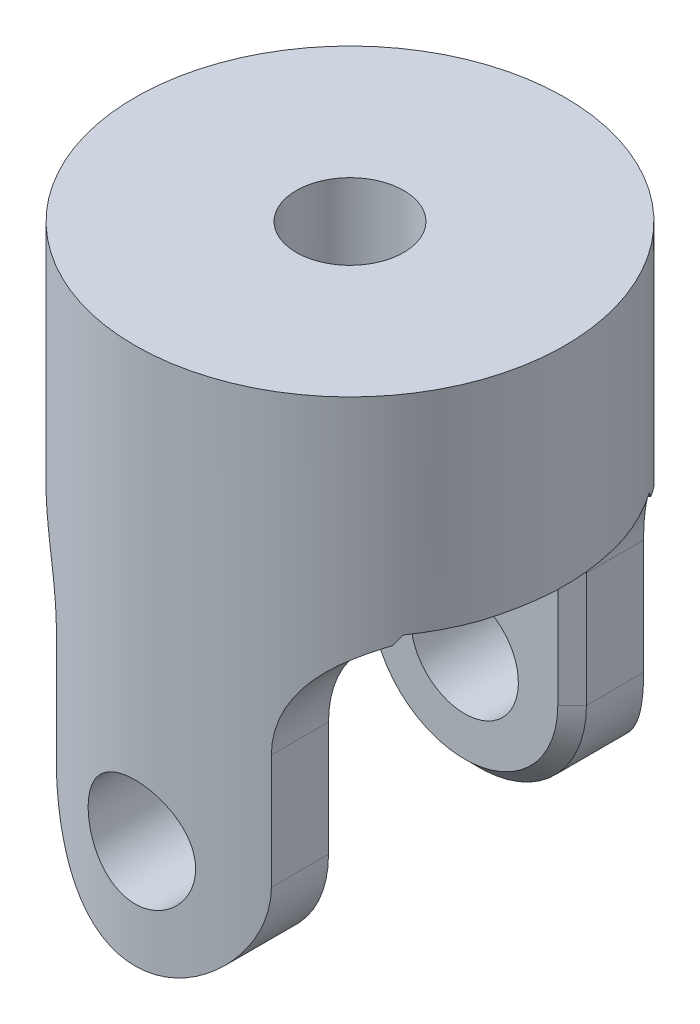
ISO-10303-21;
HEADER;
FILE_DESCRIPTION(('STEP AP214'),'2;1');
FILE_NAME('part.step','',(''),(''),'','','');
FILE_SCHEMA(('AUTOMOTIVE_DESIGN { 1 0 10303 214 1 1 1 1 }'));
ENDSEC;
DATA;
#1=APPLICATION_CONTEXT('core data for automotive mechanical design processes');
#2=APPLICATION_PROTOCOL_DEFINITION('international standard','automotive_design',2000,#1);
#3=PRODUCT_CONTEXT('',#1,'mechanical');
#4=PRODUCT('Part','Part','',(#3));
#5=PRODUCT_RELATED_PRODUCT_CATEGORY('part','',(#4));
#6=PRODUCT_DEFINITION_FORMATION('','',#4);
#7=PRODUCT_DEFINITION_CONTEXT('part definition',#1,'design');
#8=PRODUCT_DEFINITION('design','',#6,#7);
#9=PRODUCT_DEFINITION_SHAPE('','',#8);
#10=(LENGTH_UNIT() NAMED_UNIT(*) SI_UNIT(.MILLI.,.METRE.));
#11=(NAMED_UNIT(*) PLANE_ANGLE_UNIT() SI_UNIT($,.RADIAN.));
#12=(NAMED_UNIT(*) SI_UNIT($,.STERADIAN.) SOLID_ANGLE_UNIT());
#13=UNCERTAINTY_MEASURE_WITH_UNIT(LENGTH_MEASURE(1.E-05),#10,'distance_accuracy_value','');
#14=(GEOMETRIC_REPRESENTATION_CONTEXT(3) GLOBAL_UNCERTAINTY_ASSIGNED_CONTEXT((#13)) GLOBAL_UNIT_ASSIGNED_CONTEXT((#10,
#11,#12)) REPRESENTATION_CONTEXT('',''));
#15=CARTESIAN_POINT('',(0.,0.,0.));
#16=DIRECTION('',(0.,0.,1.));
#17=DIRECTION('',(1.,0.,0.));
#18=AXIS2_PLACEMENT_3D('',#15,#16,#17);
#19=CARTESIAN_POINT('',(0.,47.625,0.));
#20=DIRECTION('',(0.,-1.,0.));
#21=DIRECTION('',(0.,0.,-1.));
#22=AXIS2_PLACEMENT_3D('',#19,#20,#21);
#23=CYLINDRICAL_SURFACE('',#22,19.05);
#24=CARTESIAN_POINT('',(0.,14.2875,-19.05));
#25=CARTESIAN_POINT('',(-0.263131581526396,14.2874926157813,-19.0499955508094));
#26=CARTESIAN_POINT('',(-0.526345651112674,14.2656193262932,-19.0444938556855));
#27=CARTESIAN_POINT('',(-1.04523007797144,14.1788351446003,-19.0230796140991));
#28=CARTESIAN_POINT('',(-1.3008960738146,14.1138998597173,-19.0071611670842));
#29=CARTESIAN_POINT('',(-1.79711626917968,13.9432053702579,-18.966676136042));
#30=CARTESIAN_POINT('',(-2.03768821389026,13.837495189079,-18.9421199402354));
#31=CARTESIAN_POINT('',(-2.49768401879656,13.5884240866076,-18.886974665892));
#32=CARTESIAN_POINT('',(-2.71710716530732,13.4450618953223,-18.8563853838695));
#33=CARTESIAN_POINT('',(-3.1330961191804,13.121637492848,-18.7917903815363));
#34=CARTESIAN_POINT('',(-3.32916431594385,12.940945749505,-18.757731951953));
#35=CARTESIAN_POINT('',(-3.68855284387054,12.5493392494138,-18.6903874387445));
#36=CARTESIAN_POINT('',(-3.85186947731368,12.3384210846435,-18.6571014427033));
#37=CARTESIAN_POINT('',(-4.14345927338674,11.8884851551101,-18.5945391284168));
#38=CARTESIAN_POINT('',(-4.27117578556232,11.6490964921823,-18.5653297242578));
#39=CARTESIAN_POINT('',(-4.48436018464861,11.1513987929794,-18.514996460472));
#40=CARTESIAN_POINT('',(-4.56983482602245,10.8930927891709,-18.4938713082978));
#41=CARTESIAN_POINT('',(-4.69441160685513,10.3703643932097,-18.4626401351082));
#42=CARTESIAN_POINT('',(-4.73440845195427,10.1061682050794,-18.4523218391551));
#43=CARTESIAN_POINT('',(-4.76968113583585,9.57462979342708,-18.443237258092));
#44=CARTESIAN_POINT('',(-4.7649642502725,9.30728808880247,-18.4444690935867));
#45=CARTESIAN_POINT('',(-4.71165721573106,8.78390481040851,-18.4581547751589));
#46=CARTESIAN_POINT('',(-4.66413323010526,8.52774640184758,-18.4703359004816));
#47=CARTESIAN_POINT('',(-4.528261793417,8.02715866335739,-18.5041130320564));
#48=CARTESIAN_POINT('',(-4.43991143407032,7.78273017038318,-18.5257097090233));
#49=CARTESIAN_POINT('',(-4.22398659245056,7.30968179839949,-18.5761348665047));
#50=CARTESIAN_POINT('',(-4.09602516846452,7.08124640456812,-18.6050341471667));
#51=CARTESIAN_POINT('',(-3.80478117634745,6.6487080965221,-18.6667683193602));
#52=CARTESIAN_POINT('',(-3.64149242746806,6.44460944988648,-18.6996038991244));
#53=CARTESIAN_POINT('',(-3.27870637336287,6.06042852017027,-18.7666592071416));
#54=CARTESIAN_POINT('',(-3.07830936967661,5.88119699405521,-18.8008917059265));
#55=CARTESIAN_POINT('',(-2.64989283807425,5.55872255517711,-18.8660394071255));
#56=CARTESIAN_POINT('',(-2.42187246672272,5.41548074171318,-18.8969545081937));
#57=CARTESIAN_POINT('',(-1.94346794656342,5.16873938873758,-18.9521379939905));
#58=CARTESIAN_POINT('',(-1.69300967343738,5.06537804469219,-18.9763831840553));
#59=CARTESIAN_POINT('',(-1.17753132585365,4.90246255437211,-19.0153263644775));
#60=CARTESIAN_POINT('',(-0.912514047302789,4.84290002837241,-19.0300261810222));
#61=CARTESIAN_POINT('',(-0.382714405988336,4.77057222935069,-19.0479521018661));
#62=CARTESIAN_POINT('',(-0.118099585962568,4.75664839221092,-19.0514621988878));
#63=CARTESIAN_POINT('',(0.409679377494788,4.77281558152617,-19.0474220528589));
#64=CARTESIAN_POINT('',(0.672843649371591,4.80290264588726,-19.0398728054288));
#65=CARTESIAN_POINT('',(1.18622530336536,4.90528263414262,-19.0147442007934));
#66=CARTESIAN_POINT('',(1.43657675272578,4.97694351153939,-18.9973151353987));
#67=CARTESIAN_POINT('',(1.92169190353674,5.15971499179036,-18.9543914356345));
#68=CARTESIAN_POINT('',(2.15645402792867,5.27082957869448,-18.928895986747));
#69=CARTESIAN_POINT('',(2.60833595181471,5.5315997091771,-18.8719875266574));
#70=CARTESIAN_POINT('',(2.82506877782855,5.6819041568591,-18.8404775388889));
#71=CARTESIAN_POINT('',(3.23064699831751,6.015957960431,-18.7751881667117));
#72=CARTESIAN_POINT('',(3.41948756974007,6.19971308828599,-18.7414083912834));
#73=CARTESIAN_POINT('',(3.76869505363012,6.60083122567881,-18.6743643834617));
#74=CARTESIAN_POINT('',(3.92824927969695,6.81890845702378,-18.6411331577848));
#75=CARTESIAN_POINT('',(4.20849665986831,7.27942611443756,-18.5798738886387));
#76=CARTESIAN_POINT('',(4.32919153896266,7.5218654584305,-18.5518456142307));
#77=CARTESIAN_POINT('',(4.5273957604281,8.02292566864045,-18.5044745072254));
#78=CARTESIAN_POINT('',(4.60516095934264,8.28144021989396,-18.4850803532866));
#79=CARTESIAN_POINT('',(4.71597247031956,8.80843310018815,-18.457124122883));
#80=CARTESIAN_POINT('',(4.7490285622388,9.0769092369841,-18.4485596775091));
#81=CARTESIAN_POINT('',(4.76897252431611,9.6079342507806,-18.4434131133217));
#82=CARTESIAN_POINT('',(4.75715932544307,9.87043185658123,-18.4464938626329));
#83=CARTESIAN_POINT('',(4.69067285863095,10.3895648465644,-18.4635111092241));
#84=CARTESIAN_POINT('',(4.63600045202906,10.6462003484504,-18.4774473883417));
#85=CARTESIAN_POINT('',(4.48605693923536,11.1449118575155,-18.5144175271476));
#86=CARTESIAN_POINT('',(4.39102945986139,11.3870654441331,-18.5373967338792));
#87=CARTESIAN_POINT('',(4.1632661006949,11.8521650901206,-18.5898712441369));
#88=CARTESIAN_POINT('',(4.03052499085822,12.0751084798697,-18.6193674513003));
#89=CARTESIAN_POINT('',(3.72703010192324,12.5017359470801,-18.6825138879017));
#90=CARTESIAN_POINT('',(3.5553750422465,12.7047659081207,-18.7162524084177));
#91=CARTESIAN_POINT('',(3.18068125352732,13.0795618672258,-18.7835548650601));
#92=CARTESIAN_POINT('',(2.97763508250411,13.2513204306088,-18.8171187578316));
#93=CARTESIAN_POINT('',(2.54148458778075,13.5617309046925,-18.8810155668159));
#94=CARTESIAN_POINT('',(2.30790249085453,13.6997268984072,-18.911278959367));
#95=CARTESIAN_POINT('',(1.82011973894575,13.9342731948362,-18.9644313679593));
#96=CARTESIAN_POINT('',(1.56593401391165,14.0308531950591,-18.9873256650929));
#97=CARTESIAN_POINT('',(1.09350255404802,14.1654905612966,-19.0197758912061));
#98=CARTESIAN_POINT('',(0.87750704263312,14.2111451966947,-19.031032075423));
#99=CARTESIAN_POINT('',(0.441026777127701,14.2721518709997,-19.0461457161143));
#100=CARTESIAN_POINT('',(0.220542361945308,14.2875061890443,-19.0500037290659));
#101=CARTESIAN_POINT('',(0.,14.2875,-19.05));
#102=B_SPLINE_CURVE_WITH_KNOTS('',3,(#24,#25,#26,#27,#28,#29,#30,#31,#32,#33,#34,#35,#36,#37,
#38,#39,#40,#41,#42,#43,#44,#45,#46,#47,#48,#49,#50,#51,#52,#53,#54,#55,#56,#57,#58,#59,#60,#61,
#62,#63,#64,#65,#66,#67,#68,#69,#70,#71,#72,#73,#74,#75,#76,#77,#78,#79,#80,#81,#82,#83,#84,#85,
#86,#87,#88,#89,#90,#91,#92,#93,#94,#95,#96,#97,#98,#99,#100,#101),.UNSPECIFIED.,.T.,.F.,(4,2,2,
2,2,2,2,2,2,2,2,2,2,2,2,2,2,2,2,2,2,2,2,2,2,2,2,2,2,2,2,2,2,2,2,2,2,2,4),(0.,0.78858653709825,
1.57762015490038,2.36570806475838,3.15382256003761,3.95650832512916,4.75928466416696,
5.57398705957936,6.38855914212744,7.18681236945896,7.98493571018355,8.76371428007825,
9.54254833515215,10.3292442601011,11.1160779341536,11.9253476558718,12.7346420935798,
13.5467162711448,14.3586350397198,15.1497763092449,15.940846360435,16.7201937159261,
17.4996197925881,18.2928764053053,19.08627002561,19.8991381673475,20.7119702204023,
21.5199040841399,22.3276611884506,23.1122150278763,23.8967531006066,24.6766207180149,
25.4565965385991,26.2569190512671,27.0574315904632,27.8724418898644,28.6868668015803,
29.3478662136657,30.008815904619),.UNSPECIFIED.);
#103=CARTESIAN_POINT('',(0.,14.2875,-19.05));
#104=VERTEX_POINT('',#103);
#105=EDGE_CURVE('E245',#104,#104,#102,.T.);
#106=ORIENTED_EDGE('',*,*,#105,.T.);
#107=EDGE_LOOP('',(#106));
#108=FACE_BOUND('',#107,.T.);
#109=CARTESIAN_POINT('',(4.7625,9.525,18.4450831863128));
#110=CARTESIAN_POINT('',(4.7624925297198,9.26201331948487,18.4450882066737));
#111=CARTESIAN_POINT('',(4.74064249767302,8.99894396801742,18.4507690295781));
#112=CARTESIAN_POINT('',(4.65395905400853,8.48035976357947,18.4728204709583));
#113=CARTESIAN_POINT('',(4.58910062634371,8.22484939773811,18.4891973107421));
#114=CARTESIAN_POINT('',(4.41863073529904,7.72895925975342,18.5306727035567));
#115=CARTESIAN_POINT('',(4.31307188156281,7.48856041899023,18.5557599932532));
#116=CARTESIAN_POINT('',(4.06435777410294,7.02885782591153,18.6118155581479));
#117=CARTESIAN_POINT('',(3.92120092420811,6.80955496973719,18.6427840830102));
#118=CARTESIAN_POINT('',(3.59798955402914,6.39344356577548,18.7078756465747));
#119=CARTESIAN_POINT('',(3.41725927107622,6.19716769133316,18.7420490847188));
#120=CARTESIAN_POINT('',(3.02548683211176,5.83737454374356,18.8092627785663));
#121=CARTESIAN_POINT('',(2.81444184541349,5.67386033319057,18.8423029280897));
#122=CARTESIAN_POINT('',(2.36438160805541,5.38205273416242,18.9040849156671));
#123=CARTESIAN_POINT('',(2.12501716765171,5.25428263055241,18.9327603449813));
#124=CARTESIAN_POINT('',(1.62737136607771,5.04099262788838,18.98200696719));
#125=CARTESIAN_POINT('',(1.36909280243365,4.95546649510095,19.0025793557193));
#126=CARTESIAN_POINT('',(0.846503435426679,4.8307983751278,19.0329456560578));
#127=CARTESIAN_POINT('',(0.582420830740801,4.79075182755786,19.0429494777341));
#128=CARTESIAN_POINT('',(0.0511089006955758,4.75534028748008,19.0517829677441));
#129=CARTESIAN_POINT('',(-0.216119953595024,4.75996868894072,19.0506142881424));
#130=CARTESIAN_POINT('',(-0.739865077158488,4.81312508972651,19.0373907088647));
#131=CARTESIAN_POINT('',(-0.996487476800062,4.86067669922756,19.0255779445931));
#132=CARTESIAN_POINT('',(-1.4979884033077,4.99676026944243,18.992675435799));
#133=CARTESIAN_POINT('',(-1.74286630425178,5.08529441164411,18.9715851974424));
#134=CARTESIAN_POINT('',(-2.21649942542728,5.30161989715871,18.9221270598));
#135=CARTESIAN_POINT('',(-2.44508897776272,5.42975872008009,18.8936951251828));
#136=CARTESIAN_POINT('',(-2.87786265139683,5.72139256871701,18.8326376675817));
#137=CARTESIAN_POINT('',(-3.08204251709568,5.88489374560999,18.8000114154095));
#138=CARTESIAN_POINT('',(-3.46602384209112,6.24784515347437,18.733078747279));
#139=CARTESIAN_POINT('',(-3.6450159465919,6.44814856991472,18.6987507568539));
#140=CARTESIAN_POINT('',(-3.96704999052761,6.87628794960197,18.6330915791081));
#141=CARTESIAN_POINT('',(-4.11009024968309,7.10412519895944,18.6017605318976));
#142=CARTESIAN_POINT('',(-4.35667846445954,7.58245251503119,18.5455654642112));
#143=CARTESIAN_POINT('',(-4.46003156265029,7.8330470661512,18.5207335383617));
#144=CARTESIAN_POINT('',(-4.6228902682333,8.34882531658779,18.4807600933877));
#145=CARTESIAN_POINT('',(-4.68240525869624,8.61400588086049,18.4656165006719));
#146=CARTESIAN_POINT('',(-4.75455546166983,9.14392285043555,18.4471695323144));
#147=CARTESIAN_POINT('',(-4.76838735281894,9.40848599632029,18.4435639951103));
#148=CARTESIAN_POINT('',(-4.75205486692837,9.93614078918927,18.4477788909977));
#149=CARTESIAN_POINT('',(-4.72189453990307,10.1992325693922,18.4555982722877));
#150=CARTESIAN_POINT('',(-4.61948300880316,10.7120326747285,18.4814924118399));
#151=CARTESIAN_POINT('',(-4.54792855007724,10.9618895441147,18.4993972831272));
#152=CARTESIAN_POINT('',(-4.36553244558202,11.4460619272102,18.5432836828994));
#153=CARTESIAN_POINT('',(-4.25468614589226,11.6803755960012,18.5692661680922));
#154=CARTESIAN_POINT('',(-3.99434812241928,12.1318806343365,18.6270164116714));
#155=CARTESIAN_POINT('',(-3.84414094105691,12.3486459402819,18.6588876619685));
#156=CARTESIAN_POINT('',(-3.51024964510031,12.7543338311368,18.7245704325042));
#157=CARTESIAN_POINT('',(-3.32656002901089,12.9432518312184,18.7583822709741));
#158=CARTESIAN_POINT('',(-2.92542620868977,13.2927300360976,18.8251605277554));
#159=CARTESIAN_POINT('',(-2.70725242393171,13.4524624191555,18.8580846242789));
#160=CARTESIAN_POINT('',(-2.24648402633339,13.7330228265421,18.9185019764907));
#161=CARTESIAN_POINT('',(-2.00389068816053,13.8538528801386,18.9459955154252));
#162=CARTESIAN_POINT('',(-1.50284593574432,14.0521296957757,18.9922807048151));
#163=CARTESIAN_POINT('',(-1.24452402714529,14.1298884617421,19.0111347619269));
#164=CARTESIAN_POINT('',(-0.717945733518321,14.240751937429,19.0382898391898));
#165=CARTESIAN_POINT('',(-0.449691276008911,14.2738652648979,19.0465928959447));
#166=CARTESIAN_POINT('',(0.0813602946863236,14.2940131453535,19.0516273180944));
#167=CARTESIAN_POINT('',(0.344108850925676,14.2822693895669,19.0486654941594));
#168=CARTESIAN_POINT('',(0.863762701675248,14.2158347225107,19.0321833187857));
#169=CARTESIAN_POINT('',(1.12066816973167,14.1611450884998,19.0186632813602));
#170=CARTESIAN_POINT('',(1.62006455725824,14.0110263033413,18.9826312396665));
#171=CARTESIAN_POINT('',(1.86262563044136,13.9158180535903,18.9601680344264));
#172=CARTESIAN_POINT('',(2.32846746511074,13.6875651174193,18.908615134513));
#173=CARTESIAN_POINT('',(2.55174579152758,13.5545156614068,18.8795246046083));
#174=CARTESIAN_POINT('',(2.97847668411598,13.2506311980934,18.8169827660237));
#175=CARTESIAN_POINT('',(3.18132613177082,13.0789673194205,18.7834436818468));
#176=CARTESIAN_POINT('',(3.55575403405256,12.7043361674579,18.7161796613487));
#177=CARTESIAN_POINT('',(3.72732454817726,12.5013609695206,18.6824546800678));
#178=CARTESIAN_POINT('',(4.0374666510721,12.0653107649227,18.6179210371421));
#179=CARTESIAN_POINT('',(4.1753628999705,11.831744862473,18.5871785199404));
#180=CARTESIAN_POINT('',(4.4097268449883,11.3440107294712,18.5329808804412));
#181=CARTESIAN_POINT('',(4.50622468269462,11.0898576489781,18.5095204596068));
#182=CARTESIAN_POINT('',(4.6406872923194,10.6176269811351,18.4762096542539));
#183=CARTESIAN_POINT('',(4.68626747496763,10.401808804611,18.4646250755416));
#184=CARTESIAN_POINT('',(4.74717566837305,9.96567951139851,18.4490600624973));
#185=CARTESIAN_POINT('',(4.76250625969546,9.74536877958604,18.4450789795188));
#186=CARTESIAN_POINT('',(4.7625,9.525,18.4450831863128));
#187=B_SPLINE_CURVE_WITH_KNOTS('',3,(#109,#110,#111,#112,#113,#114,#115,#116,#117,#118,#119,
#120,#121,#122,#123,#124,#125,#126,#127,#128,#129,#130,#131,#132,#133,#134,#135,#136,#137,#138,
#139,#140,#141,#142,#143,#144,#145,#146,#147,#148,#149,#150,#151,#152,#153,#154,#155,#156,#157,
#158,#159,#160,#161,#162,#163,#164,#165,#166,#167,#168,#169,#170,#171,#172,#173,#174,#175,#176,
#177,#178,#179,#180,#181,#182,#183,#184,#185,#186),.UNSPECIFIED.,.T.,.F.,(4,2,2,2,2,2,2,2,2,2,2,
2,2,2,2,2,2,2,2,2,2,2,2,2,2,2,2,2,2,2,2,2,2,2,2,2,2,2,4),(0.,0.788150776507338,1.57676038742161,
2.36435403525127,3.15198112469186,3.95523632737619,4.75856658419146,5.57310600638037,
6.3875251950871,7.18544570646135,7.98324823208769,8.76334790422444,9.54348910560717,
10.3306792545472,11.1180064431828,11.9266423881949,12.7353161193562,13.5479110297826,
14.3603319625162,15.1512950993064,15.9421854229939,16.7201355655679,17.4981778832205,
18.2914832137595,19.0849190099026,19.8982075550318,20.7114536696,21.5187289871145,
22.3258484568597,23.1111446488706,23.896417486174,24.677462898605,25.4586067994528,
26.258464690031,27.0585253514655,27.8735118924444,28.6879040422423,29.3483886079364,
30.0088168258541),.UNSPECIFIED.);
#188=CARTESIAN_POINT('',(4.7625,9.525,18.4450831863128));
#189=VERTEX_POINT('',#188);
#190=EDGE_CURVE('E249',#189,#189,#187,.T.);
#191=ORIENTED_EDGE('',*,*,#190,.T.);
#192=EDGE_LOOP('',(#191));
#193=FACE_BOUND('',#192,.T.);
#194=CARTESIAN_POINT('',(0.,47.625,0.));
#195=DIRECTION('',(0.,1.,0.));
#196=DIRECTION('',(0.,0.,1.));
#197=AXIS2_PLACEMENT_3D('',#194,#195,#196);
#198=CIRCLE('',#197,19.05);
#199=CARTESIAN_POINT('',(0.,47.625,19.05));
#200=VERTEX_POINT('',#199);
#201=EDGE_CURVE('E252',#200,#200,#198,.T.);
#202=ORIENTED_EDGE('',*,*,#201,.F.);
#203=EDGE_LOOP('',(#202));
#204=FACE_BOUND('',#203,.T.);
#205=CARTESIAN_POINT('',(0.,29.1452388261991,0.));
#206=DIRECTION('',(0.,-1.,0.));
#207=DIRECTION('',(0.,0.,-1.));
#208=AXIS2_PLACEMENT_3D('',#205,#206,#207);
#209=CIRCLE('',#208,19.05);
#210=CARTESIAN_POINT('',(15.6272218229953,29.1452388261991,-10.8946059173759));
#211=VERTEX_POINT('',#210);
#212=CARTESIAN_POINT('',(17.9411689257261,29.1452388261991,-6.40444826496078));
#213=VERTEX_POINT('',#212);
#214=EDGE_CURVE('E171',#211,#213,#209,.T.);
#215=ORIENTED_EDGE('',*,*,#214,.F.);
#216=CARTESIAN_POINT('',(15.6272218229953,29.1452388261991,-10.8946059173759));
#217=CARTESIAN_POINT('',(15.5953162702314,29.085026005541,-10.9403714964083));
#218=CARTESIAN_POINT('',(15.5633026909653,29.0246618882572,-10.9858629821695));
#219=CARTESIAN_POINT('',(15.4990870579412,28.9036154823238,-11.0762752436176));
#220=CARTESIAN_POINT('',(15.4668850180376,28.8429332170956,-11.1211960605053));
#221=CARTESIAN_POINT('',(15.4023152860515,28.7212259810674,-11.2104512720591));
#222=CARTESIAN_POINT('',(15.3699475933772,28.6602010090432,-11.2547856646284));
#223=CARTESIAN_POINT('',(15.3050717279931,28.537783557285,-11.3428511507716));
#224=CARTESIAN_POINT('',(15.2725635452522,28.476391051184,-11.3865822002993));
#225=CARTESIAN_POINT('',(15.24,28.4148066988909,-11.43));
#226=B_SPLINE_CURVE_WITH_KNOTS('',3,(#216,#217,#218,#219,#220,#221,#222,#223,#224,#225),
.UNSPECIFIED.,.F.,.F.,(4,2,2,2,4),(0.,0.246256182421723,0.492494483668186,0.738733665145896,
0.984990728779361),.UNSPECIFIED.);
#227=CARTESIAN_POINT('',(15.24,28.4148066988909,-11.43));
#228=VERTEX_POINT('',#227);
#229=EDGE_CURVE('E377',#211,#228,#226,.T.);
#230=ORIENTED_EDGE('',*,*,#229,.T.);
#231=CARTESIAN_POINT('',(9.525,19.685,16.4977839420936));
#232=CARTESIAN_POINT('',(9.52496088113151,19.918350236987,16.4977688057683));
#233=CARTESIAN_POINT('',(9.53357353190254,20.1516967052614,16.4928328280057));
#234=CARTESIAN_POINT('',(9.56782146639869,20.6166980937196,16.4730087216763));
#235=CARTESIAN_POINT('',(9.59345572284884,20.8483531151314,16.4581211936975));
#236=CARTESIAN_POINT('',(9.66141942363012,21.3080009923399,16.4183108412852));
#237=CARTESIAN_POINT('',(9.70372594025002,21.5359984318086,16.3934017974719));
#238=CARTESIAN_POINT('',(9.80447669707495,21.9870210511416,16.3333461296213));
#239=CARTESIAN_POINT('',(9.86292069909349,22.2100463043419,16.2981996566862));
#240=CARTESIAN_POINT('',(9.99521577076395,22.6496636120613,16.217402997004));
#241=CARTESIAN_POINT('',(10.0690752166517,22.8662520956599,16.1717470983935));
#242=CARTESIAN_POINT('',(10.2311827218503,23.2913603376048,16.0696785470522));
#243=CARTESIAN_POINT('',(10.3194309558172,23.4998799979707,16.0132657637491));
#244=CARTESIAN_POINT('',(10.5090589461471,23.9073731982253,15.8894615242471));
#245=CARTESIAN_POINT('',(10.6104339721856,24.1063501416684,15.8220740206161));
#246=CARTESIAN_POINT('',(10.8249101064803,24.4935871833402,15.676116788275));
#247=CARTESIAN_POINT('',(10.9380111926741,24.6818473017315,15.597547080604));
#248=CARTESIAN_POINT('',(11.1750060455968,25.0476354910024,15.4286429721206));
#249=CARTESIAN_POINT('',(11.2989577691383,25.2250961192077,15.3382439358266));
#250=CARTESIAN_POINT('',(11.5553164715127,25.5672655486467,15.1460495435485));
#251=CARTESIAN_POINT('',(11.6877234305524,25.7319743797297,15.0442542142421));
#252=CARTESIAN_POINT('',(11.9591574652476,26.0480960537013,14.8293967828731));
#253=CARTESIAN_POINT('',(12.0981857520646,26.1995064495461,14.7163326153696));
#254=CARTESIAN_POINT('',(12.3809708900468,26.488718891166,14.4792302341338));
#255=CARTESIAN_POINT('',(12.5247282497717,26.6265194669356,14.3551908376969));
#256=CARTESIAN_POINT('',(12.8240785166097,26.8965620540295,14.0885806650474));
#257=CARTESIAN_POINT('',(12.9798547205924,27.0279377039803,13.945338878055));
#258=CARTESIAN_POINT('',(13.292575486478,27.2756182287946,13.6475843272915));
#259=CARTESIAN_POINT('',(13.4495200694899,27.3919228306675,13.4930713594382));
#260=CARTESIAN_POINT('',(13.7627279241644,27.6100750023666,13.1734537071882));
#261=CARTESIAN_POINT('',(13.91899104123,27.7119194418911,13.0083467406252));
#262=CARTESIAN_POINT('',(14.2291584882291,27.9019462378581,12.6683290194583));
#263=CARTESIAN_POINT('',(14.3830623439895,27.9901258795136,12.4934163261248));
#264=CARTESIAN_POINT('',(14.7634251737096,28.1948863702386,12.0444336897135));
#265=CARTESIAN_POINT('',(14.9875078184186,28.3034922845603,11.7646791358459));
#266=CARTESIAN_POINT('',(15.4232003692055,28.4957157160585,11.1874194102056));
#267=CARTESIAN_POINT('',(15.6348051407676,28.5793230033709,10.8899070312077));
#268=CARTESIAN_POINT('',(16.0431146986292,28.7255421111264,10.2789237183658));
#269=CARTESIAN_POINT('',(16.2397846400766,28.7881059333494,9.96541815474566));
#270=CARTESIAN_POINT('',(16.615638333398,28.8957388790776,9.32528378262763));
#271=CARTESIAN_POINT('',(16.7948218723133,28.9408077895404,8.99865481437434));
#272=CARTESIAN_POINT('',(17.1918461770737,29.029905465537,8.22145899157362));
#273=CARTESIAN_POINT('',(17.4021973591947,29.0684013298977,7.76641658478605));
#274=CARTESIAN_POINT('',(17.786699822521,29.1278564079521,6.84014068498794));
#275=CARTESIAN_POINT('',(17.9608394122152,29.1488099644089,6.36890201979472));
#276=CARTESIAN_POINT('',(18.2714417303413,29.1794105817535,5.41378881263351));
#277=CARTESIAN_POINT('',(18.4079009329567,29.1890565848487,4.92991309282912));
#278=CARTESIAN_POINT('',(18.6421466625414,29.2019870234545,3.95287775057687));
#279=CARTESIAN_POINT('',(18.7399368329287,29.2052720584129,3.45971900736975));
#280=CARTESIAN_POINT('',(18.897358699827,29.2091078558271,2.46008138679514));
#281=CARTESIAN_POINT('',(18.9564226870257,29.2096187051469,1.95351291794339));
#282=CARTESIAN_POINT('',(19.033752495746,29.2100647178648,0.93726372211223));
#283=CARTESIAN_POINT('',(19.0520174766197,29.209999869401,0.427582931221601));
#284=CARTESIAN_POINT('',(19.0476285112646,29.2100001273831,-0.59182555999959));
#285=CARTESIAN_POINT('',(19.0249568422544,29.2100652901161,-1.10155318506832));
#286=CARTESIAN_POINT('',(18.9388075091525,29.2094475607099,-2.11754548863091));
#287=CARTESIAN_POINT('',(18.8753295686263,29.2087646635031,-2.62381014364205));
#288=CARTESIAN_POINT('',(18.7036160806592,29.2041086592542,-3.65580332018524));
#289=CARTESIAN_POINT('',(18.5932233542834,29.1999661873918,-4.18117378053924));
#290=CARTESIAN_POINT('',(18.3285057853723,29.1835599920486,-5.22073652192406));
#291=CARTESIAN_POINT('',(18.1741722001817,29.1712946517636,-5.73492655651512));
#292=CARTESIAN_POINT('',(17.8230306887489,29.1322930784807,-6.74751648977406));
#293=CARTESIAN_POINT('',(17.6262637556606,29.1055707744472,-7.24593109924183));
#294=CARTESIAN_POINT('',(17.1921907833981,29.0296619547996,-8.22291578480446));
#295=CARTESIAN_POINT('',(16.9549063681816,28.9804873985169,-8.70149627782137));
#296=CARTESIAN_POINT('',(16.5317482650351,28.8726944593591,-9.47232063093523));
#297=CARTESIAN_POINT('',(16.356505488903,28.8232353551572,-9.77172744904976));
#298=CARTESIAN_POINT('',(15.9915321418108,28.7076409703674,-10.3582119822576));
#299=CARTESIAN_POINT('',(15.8018055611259,28.6415102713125,-10.6452930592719));
#300=CARTESIAN_POINT('',(15.4100602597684,28.4895738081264,-11.2048655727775));
#301=CARTESIAN_POINT('',(15.2080616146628,28.4037995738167,-11.4773795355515));
#302=CARTESIAN_POINT('',(14.794100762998,28.2093882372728,-12.0062371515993));
#303=CARTESIAN_POINT('',(14.5821407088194,28.1007560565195,-12.2625842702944));
#304=CARTESIAN_POINT('',(14.1961331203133,27.8828084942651,-12.7059055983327));
#305=CARTESIAN_POINT('',(14.0232896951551,27.7782615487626,-12.8962780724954));
#306=CARTESIAN_POINT('',(13.6756323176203,27.5516907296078,-13.2643740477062));
#307=CARTESIAN_POINT('',(13.500818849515,27.4296710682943,-13.4421005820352));
#308=CARTESIAN_POINT('',(13.1516762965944,27.1671845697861,-13.7838888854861));
#309=CARTESIAN_POINT('',(12.9773471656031,27.0267195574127,-13.947952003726));
#310=CARTESIAN_POINT('',(12.6319391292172,26.726763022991,-14.2615225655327));
#311=CARTESIAN_POINT('',(12.4608602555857,26.5672713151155,-14.4110298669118));
#312=CARTESIAN_POINT('',(12.1237135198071,26.2279198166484,-14.6958204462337));
#313=CARTESIAN_POINT('',(11.957692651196,26.0479167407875,-14.8309890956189));
#314=CARTESIAN_POINT('',(11.6351953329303,25.6689938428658,-15.0853214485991));
#315=CARTESIAN_POINT('',(11.4787191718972,25.4700734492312,-15.2044846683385));
#316=CARTESIAN_POINT('',(11.1784747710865,25.0543983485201,-15.4265708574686));
#317=CARTESIAN_POINT('',(11.0347050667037,24.8376457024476,-15.5294956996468));
#318=CARTESIAN_POINT('',(10.7628059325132,24.3878782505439,-15.7191604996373));
#319=CARTESIAN_POINT('',(10.6346741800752,24.154865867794,-15.8059028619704));
#320=CARTESIAN_POINT('',(10.4115375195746,23.7046522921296,-15.9536199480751));
#321=CARTESIAN_POINT('',(10.3143937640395,23.4891174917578,-16.0164604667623));
#322=CARTESIAN_POINT('',(10.1355425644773,23.04871010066,-16.1302361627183));
#323=CARTESIAN_POINT('',(10.0538339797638,22.8238382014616,-16.181172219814));
#324=CARTESIAN_POINT('',(9.90713729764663,22.3666546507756,-16.2714028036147));
#325=CARTESIAN_POINT('',(9.84213485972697,22.1343495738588,-16.3107073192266));
#326=CARTESIAN_POINT('',(9.72972257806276,21.6640173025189,-16.3780123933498));
#327=CARTESIAN_POINT('',(9.6823065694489,21.4259921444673,-16.4060169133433));
#328=CARTESIAN_POINT('',(9.60449707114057,20.9383691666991,-16.4516946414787));
#329=CARTESIAN_POINT('',(9.57468865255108,20.6886433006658,-16.4690135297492));
#330=CARTESIAN_POINT('',(9.54488066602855,20.3127872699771,-16.48629321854));
#331=CARTESIAN_POINT('',(9.5374287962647,20.1873921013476,-16.4906033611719));
#332=CARTESIAN_POINT('',(9.52748802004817,19.9363374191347,-16.4963477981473));
#333=CARTESIAN_POINT('',(9.52499919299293,19.8106779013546,-16.4977820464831));
#334=CARTESIAN_POINT('',(9.525,19.685,-16.4977839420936));
#335=B_SPLINE_CURVE_WITH_KNOTS('',3,(#231,#232,#233,#234,#235,#236,#237,#238,#239,#240,#241,
#242,#243,#244,#245,#246,#247,#248,#249,#250,#251,#252,#253,#254,#255,#256,#257,#258,#259,#260,
#261,#262,#263,#264,#265,#266,#267,#268,#269,#270,#271,#272,#273,#274,#275,#276,#277,#278,#279,
#280,#281,#282,#283,#284,#285,#286,#287,#288,#289,#290,#291,#292,#293,#294,#295,#296,#297,#298,
#299,#300,#301,#302,#303,#304,#305,#306,#307,#308,#309,#310,#311,#312,#313,#314,#315,#316,#317,
#318,#319,#320,#321,#322,#323,#324,#325,#326,#327,#328,#329,#330,#331,#332,#333,#334),
.UNSPECIFIED.,.F.,.F.,(4,2,2,2,2,2,2,2,2,2,2,2,2,2,2,2,2,2,2,2,2,2,2,2,2,2,2,2,2,2,2,2,2,2,2,2,
2,2,2,2,2,2,2,2,2,2,2,2,2,2,2,4),(0.,0.699834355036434,1.39962647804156,2.09845958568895,
2.79728237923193,3.49648588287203,4.19569787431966,4.89465859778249,5.59361800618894,
6.29656980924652,6.99951996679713,7.70259920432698,8.40575429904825,9.1522568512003,
9.898772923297,10.6454503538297,11.3922759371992,12.514141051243,13.6364646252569,
14.7613310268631,15.886211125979,17.3924586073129,18.899191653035,20.40606563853,
21.9127976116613,23.4411511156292,24.9695361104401,26.4985829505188,28.0276401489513,
29.6362655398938,31.2452112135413,32.852609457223,34.4591525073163,35.50965675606,
36.5598726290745,37.6084144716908,38.6567307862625,39.4886840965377,40.3204371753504,
41.1521080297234,41.9837870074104,42.8216802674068,43.6595988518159,44.4974207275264,
45.3351180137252,46.0680642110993,46.8009562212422,47.5332170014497,48.2652208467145,
49.02034913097,49.3973072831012,49.7742714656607),.UNSPECIFIED.);
#336=CARTESIAN_POINT('',(9.525,19.685,-16.4977839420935));
#337=VERTEX_POINT('',#336);
#338=EDGE_CURVE('E195',#228,#337,#335,.T.);
#339=ORIENTED_EDGE('',*,*,#338,.T.);
#340=DIRECTION('',(0.,-1.,0.));
#341=VECTOR('',#340,1.);
#342=CARTESIAN_POINT('',(9.52499999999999,47.625,-16.4977839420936));
#343=LINE('',#342,#341);
#344=CARTESIAN_POINT('',(9.525,9.525,-16.4977839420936));
#345=VERTEX_POINT('',#344);
#346=EDGE_CURVE('E200',#337,#345,#343,.T.);
#347=ORIENTED_EDGE('',*,*,#346,.T.);
#348=CARTESIAN_POINT('',(9.525,9.525,-16.4977839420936));
#349=CARTESIAN_POINT('',(9.52500093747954,9.40027209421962,-16.4977810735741));
#350=CARTESIAN_POINT('',(9.52254953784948,9.27556178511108,-16.4991989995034));
#351=CARTESIAN_POINT('',(9.51275823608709,9.02640215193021,-16.5048470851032));
#352=CARTESIAN_POINT('',(9.50541854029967,8.90195281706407,-16.5090771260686));
#353=CARTESIAN_POINT('',(9.47610755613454,8.52953008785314,-16.5259320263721));
#354=CARTESIAN_POINT('',(9.44684431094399,8.28226939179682,-16.5427217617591));
#355=CARTESIAN_POINT('',(9.36949042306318,7.79316361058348,-16.5866541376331));
#356=CARTESIAN_POINT('',(9.32150879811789,7.55129558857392,-16.6137368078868));
#357=CARTESIAN_POINT('',(9.20730508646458,7.07314726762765,-16.6772988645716));
#358=CARTESIAN_POINT('',(9.14108090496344,6.83686761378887,-16.7137793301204));
#359=CARTESIAN_POINT('',(8.99129458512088,6.37194591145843,-16.7948308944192));
#360=CARTESIAN_POINT('',(8.90777410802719,6.1432870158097,-16.8393825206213));
#361=CARTESIAN_POINT('',(8.72407445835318,5.69419496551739,-16.9352812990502));
#362=CARTESIAN_POINT('',(8.62388892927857,5.47376498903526,-16.9866310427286));
#363=CARTESIAN_POINT('',(8.29930031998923,4.82600833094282,-17.1488397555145));
#364=CARTESIAN_POINT('',(8.05094911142,4.41247255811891,-17.2678106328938));
#365=CARTESIAN_POINT('',(7.47385251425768,3.5973923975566,-17.5257389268));
#366=CARTESIAN_POINT('',(7.14019517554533,3.19959093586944,-17.6655351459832));
#367=CARTESIAN_POINT('',(6.59462548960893,2.64723336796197,-17.873206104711));
#368=CARTESIAN_POINT('',(6.40513840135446,2.47041996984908,-17.9421298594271));
#369=CARTESIAN_POINT('',(6.01183560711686,2.13239149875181,-18.0777085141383));
#370=CARTESIAN_POINT('',(5.80801788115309,1.97117863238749,-18.1443630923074));
#371=CARTESIAN_POINT('',(5.37270663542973,1.65500163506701,-18.2781797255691));
#372=CARTESIAN_POINT('',(5.14027362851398,1.50121275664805,-18.3450665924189));
#373=CARTESIAN_POINT('',(4.66161660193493,1.21399468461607,-18.4724964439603));
#374=CARTESIAN_POINT('',(4.41539832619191,1.08055709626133,-18.5330420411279));
#375=CARTESIAN_POINT('',(3.91085391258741,0.835382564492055,-18.646031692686));
#376=CARTESIAN_POINT('',(3.6525380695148,0.723627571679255,-18.6984824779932));
#377=CARTESIAN_POINT('',(3.12549123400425,0.522978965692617,-18.7937609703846));
#378=CARTESIAN_POINT('',(2.85676300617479,0.43407933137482,-18.8365912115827));
#379=CARTESIAN_POINT('',(2.37518449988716,0.298343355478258,-18.9025247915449));
#380=CARTESIAN_POINT('',(2.16403192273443,0.246531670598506,-18.9278987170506));
#381=CARTESIAN_POINT('',(1.73799792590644,0.157378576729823,-18.9717604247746));
#382=CARTESIAN_POINT('',(1.52311697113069,0.120035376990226,-18.9902490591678));
#383=CARTESIAN_POINT('',(1.09081024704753,0.0601505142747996,-19.0199783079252));
#384=CARTESIAN_POINT('',(0.873384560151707,0.0376083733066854,-19.0312191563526));
#385=CARTESIAN_POINT('',(0.437310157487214,0.00753489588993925,-19.0462292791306));
#386=CARTESIAN_POINT('',(0.218661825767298,-9.1485758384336E-07,-19.0500007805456));
#387=CARTESIAN_POINT('',(-0.250694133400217,1.04887731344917E-06,-19.0499991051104));
#388=CARTESIAN_POINT('',(-0.501406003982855,0.00990870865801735,-19.0450397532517));
#389=CARTESIAN_POINT('',(-1.00089450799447,0.04942007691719,-19.0253305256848));
#390=CARTESIAN_POINT('',(-1.24967095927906,0.0790256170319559,-19.0105797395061));
#391=CARTESIAN_POINT('',(-1.74352182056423,0.157593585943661,-18.9716634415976));
#392=CARTESIAN_POINT('',(-1.98859433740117,0.206565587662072,-18.9474932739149));
#393=CARTESIAN_POINT('',(-2.47315765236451,0.323302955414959,-18.8903550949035));
#394=CARTESIAN_POINT('',(-2.71264852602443,0.391068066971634,-18.8573872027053));
#395=CARTESIAN_POINT('',(-3.18367027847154,0.544409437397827,-18.7835934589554));
#396=CARTESIAN_POINT('',(-3.41522564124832,0.629923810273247,-18.7427949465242));
#397=CARTESIAN_POINT('',(-3.86986980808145,0.818090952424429,-18.6542287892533));
#398=CARTESIAN_POINT('',(-4.09295860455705,0.920743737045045,-18.6064611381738));
#399=CARTESIAN_POINT('',(-4.52947545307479,1.14231625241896,-18.5050415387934));
#400=CARTESIAN_POINT('',(-4.74290423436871,1.26123475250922,-18.4513900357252));
#401=CARTESIAN_POINT('',(-5.15918821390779,1.51451979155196,-18.3393501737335));
#402=CARTESIAN_POINT('',(-5.362039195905,1.64889242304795,-18.2809599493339));
#403=CARTESIAN_POINT('',(-5.76805465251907,1.94071548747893,-18.1570856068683));
#404=CARTESIAN_POINT('',(-5.97050562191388,2.09906743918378,-18.0913860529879));
#405=CARTESIAN_POINT('',(-6.36152507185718,2.43116951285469,-17.9576225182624));
#406=CARTESIAN_POINT('',(-6.55009275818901,2.60492051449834,-17.889558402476));
#407=CARTESIAN_POINT('',(-6.912618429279,2.9670266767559,-17.7526273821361));
#408=CARTESIAN_POINT('',(-7.08656573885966,3.15539231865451,-17.6837599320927));
#409=CARTESIAN_POINT('',(-7.41889527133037,3.54575749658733,-17.5469312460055));
#410=CARTESIAN_POINT('',(-7.57727453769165,3.74775961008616,-17.4789701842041));
#411=CARTESIAN_POINT('',(-7.88939700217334,4.18086557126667,-17.3404531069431));
#412=CARTESIAN_POINT('',(-8.04179770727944,4.41300888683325,-17.2701128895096));
#413=CARTESIAN_POINT('',(-8.32627771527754,4.89078123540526,-17.1347720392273));
#414=CARTESIAN_POINT('',(-8.45836573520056,5.1364044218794,-17.0697691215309));
#415=CARTESIAN_POINT('',(-8.7009129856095,5.63943979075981,-16.9474199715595));
#416=CARTESIAN_POINT('',(-8.81140698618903,5.89683218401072,-16.8900614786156));
#417=CARTESIAN_POINT('',(-9.00978624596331,6.42207787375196,-16.7850787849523));
#418=CARTESIAN_POINT('',(-9.09767796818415,6.68992815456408,-16.7374518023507));
#419=CARTESIAN_POINT('',(-9.23137202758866,7.16843952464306,-16.66399084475));
#420=CARTESIAN_POINT('',(-9.28221306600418,7.37732581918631,-16.6356709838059));
#421=CARTESIAN_POINT('',(-9.36976215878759,7.7988749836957,-16.5865176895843));
#422=CARTESIAN_POINT('',(-9.40647369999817,8.01153690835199,-16.5656824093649));
#423=CARTESIAN_POINT('',(-9.46551135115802,8.44025591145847,-16.5320241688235));
#424=CARTESIAN_POINT('',(-9.48778591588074,8.65632236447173,-16.5192299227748));
#425=CARTESIAN_POINT('',(-9.51754790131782,9.08991896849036,-16.5020857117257));
#426=CARTESIAN_POINT('',(-9.52502732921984,9.30744984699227,-16.497740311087));
#427=CARTESIAN_POINT('',(-9.525,9.525,-16.4977839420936));
#428=B_SPLINE_CURVE_WITH_KNOTS('',3,(#348,#349,#350,#351,#352,#353,#354,#355,#356,#357,#358,
#359,#360,#361,#362,#363,#364,#365,#366,#367,#368,#369,#370,#371,#372,#373,#374,#375,#376,#377,
#378,#379,#380,#381,#382,#383,#384,#385,#386,#387,#388,#389,#390,#391,#392,#393,#394,#395,#396,
#397,#398,#399,#400,#401,#402,#403,#404,#405,#406,#407,#408,#409,#410,#411,#412,#413,#414,#415,
#416,#417,#418,#419,#420,#421,#422,#423,#424,#425,#426,#427),.UNSPECIFIED.,.F.,.F.,(4,2,2,2,2,2,
2,2,2,2,2,2,2,2,2,2,2,2,2,2,2,2,2,2,2,2,2,2,2,2,2,2,2,2,2,2,2,2,2,4),(0.,0.374116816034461,
0.748217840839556,1.4957845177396,2.23906077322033,2.98242241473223,3.72401393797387,
4.46588897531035,5.95045514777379,7.55636492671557,8.3602040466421,9.16415670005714,
10.0229175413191,10.8813231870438,11.7390111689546,12.5964729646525,13.2525713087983,
13.9085884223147,14.5645843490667,15.2203846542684,15.9722547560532,16.7241947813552,
17.4765069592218,18.2288089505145,18.9785306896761,19.7282531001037,20.4779188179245,
21.2278810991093,22.0229050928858,22.8179745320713,23.6136195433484,24.4094153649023,
25.2677509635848,26.1257171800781,26.9822903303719,27.8386182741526,28.4885666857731,
29.1383546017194,29.7904498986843,30.4428973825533),.UNSPECIFIED.);
#429=CARTESIAN_POINT('',(-9.525,9.525,-16.4977839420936));
#430=VERTEX_POINT('',#429);
#431=EDGE_CURVE('E260',#345,#430,#428,.T.);
#432=ORIENTED_EDGE('',*,*,#431,.T.);
#433=DIRECTION('',(0.,-1.,0.));
#434=VECTOR('',#433,1.);
#435=CARTESIAN_POINT('',(-9.52499999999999,47.625,-16.4977839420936));
#436=LINE('',#435,#434);
#437=CARTESIAN_POINT('',(-9.525,19.685,-16.4977839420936));
#438=VERTEX_POINT('',#437);
#439=EDGE_CURVE('E271',#438,#430,#436,.T.);
#440=ORIENTED_EDGE('',*,*,#439,.F.);
#441=CARTESIAN_POINT('',(-9.525,19.685,16.4977839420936));
#442=CARTESIAN_POINT('',(-9.52496088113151,19.918350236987,16.4977688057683));
#443=CARTESIAN_POINT('',(-9.53357353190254,20.1516967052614,16.4928328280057));
#444=CARTESIAN_POINT('',(-9.56782146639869,20.6166980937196,16.4730087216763));
#445=CARTESIAN_POINT('',(-9.59345572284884,20.8483531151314,16.4581211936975));
#446=CARTESIAN_POINT('',(-9.66141942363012,21.3080009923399,16.4183108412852));
#447=CARTESIAN_POINT('',(-9.70372594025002,21.5359984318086,16.3934017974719));
#448=CARTESIAN_POINT('',(-9.80447669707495,21.9870210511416,16.3333461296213));
#449=CARTESIAN_POINT('',(-9.86292069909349,22.2100463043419,16.2981996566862));
#450=CARTESIAN_POINT('',(-9.99521577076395,22.6496636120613,16.217402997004));
#451=CARTESIAN_POINT('',(-10.0690752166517,22.8662520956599,16.1717470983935));
#452=CARTESIAN_POINT('',(-10.2311827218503,23.2913603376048,16.0696785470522));
#453=CARTESIAN_POINT('',(-10.3194309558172,23.4998799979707,16.0132657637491));
#454=CARTESIAN_POINT('',(-10.5090589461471,23.9073731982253,15.8894615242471));
#455=CARTESIAN_POINT('',(-10.6104339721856,24.1063501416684,15.8220740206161));
#456=CARTESIAN_POINT('',(-10.8249101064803,24.4935871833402,15.676116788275));
#457=CARTESIAN_POINT('',(-10.9380111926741,24.6818473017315,15.597547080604));
#458=CARTESIAN_POINT('',(-11.1750060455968,25.0476354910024,15.4286429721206));
#459=CARTESIAN_POINT('',(-11.2989577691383,25.2250961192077,15.3382439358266));
#460=CARTESIAN_POINT('',(-11.5553164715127,25.5672655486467,15.1460495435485));
#461=CARTESIAN_POINT('',(-11.6877234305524,25.7319743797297,15.0442542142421));
#462=CARTESIAN_POINT('',(-11.9591574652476,26.0480960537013,14.8293967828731));
#463=CARTESIAN_POINT('',(-12.0981857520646,26.1995064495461,14.7163326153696));
#464=CARTESIAN_POINT('',(-12.3809708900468,26.488718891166,14.4792302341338));
#465=CARTESIAN_POINT('',(-12.5247282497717,26.6265194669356,14.3551908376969));
#466=CARTESIAN_POINT('',(-12.8240785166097,26.8965620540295,14.0885806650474));
#467=CARTESIAN_POINT('',(-12.9798547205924,27.0279377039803,13.945338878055));
#468=CARTESIAN_POINT('',(-13.292575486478,27.2756182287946,13.6475843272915));
#469=CARTESIAN_POINT('',(-13.4495200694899,27.3919228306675,13.4930713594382));
#470=CARTESIAN_POINT('',(-13.7627279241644,27.6100750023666,13.1734537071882));
#471=CARTESIAN_POINT('',(-13.91899104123,27.7119194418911,13.0083467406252));
#472=CARTESIAN_POINT('',(-14.2291584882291,27.9019462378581,12.6683290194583));
#473=CARTESIAN_POINT('',(-14.3830623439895,27.9901258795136,12.4934163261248));
#474=CARTESIAN_POINT('',(-14.7634251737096,28.1948863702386,12.0444336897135));
#475=CARTESIAN_POINT('',(-14.9875078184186,28.3034922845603,11.7646791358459));
#476=CARTESIAN_POINT('',(-15.4232003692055,28.4957157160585,11.1874194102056));
#477=CARTESIAN_POINT('',(-15.6348051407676,28.5793230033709,10.8899070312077));
#478=CARTESIAN_POINT('',(-16.0431146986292,28.7255421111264,10.2789237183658));
#479=CARTESIAN_POINT('',(-16.2397846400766,28.7881059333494,9.96541815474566));
#480=CARTESIAN_POINT('',(-16.615638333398,28.8957388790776,9.32528378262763));
#481=CARTESIAN_POINT('',(-16.7948218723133,28.9408077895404,8.99865481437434));
#482=CARTESIAN_POINT('',(-17.1918461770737,29.029905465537,8.22145899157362));
#483=CARTESIAN_POINT('',(-17.4021973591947,29.0684013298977,7.76641658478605));
#484=CARTESIAN_POINT('',(-17.786699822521,29.1278564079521,6.84014068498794));
#485=CARTESIAN_POINT('',(-17.9608394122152,29.1488099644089,6.36890201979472));
#486=CARTESIAN_POINT('',(-18.2714417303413,29.1794105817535,5.41378881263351));
#487=CARTESIAN_POINT('',(-18.4079009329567,29.1890565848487,4.92991309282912));
#488=CARTESIAN_POINT('',(-18.6421466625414,29.2019870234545,3.95287775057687));
#489=CARTESIAN_POINT('',(-18.7399368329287,29.2052720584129,3.45971900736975));
#490=CARTESIAN_POINT('',(-18.897358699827,29.2091078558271,2.46008138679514));
#491=CARTESIAN_POINT('',(-18.9564226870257,29.2096187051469,1.95351291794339));
#492=CARTESIAN_POINT('',(-19.033752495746,29.2100647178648,0.93726372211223));
#493=CARTESIAN_POINT('',(-19.0520174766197,29.209999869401,0.427582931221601));
#494=CARTESIAN_POINT('',(-19.0476285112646,29.2100001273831,-0.59182555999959));
#495=CARTESIAN_POINT('',(-19.0249568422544,29.2100652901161,-1.10155318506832));
#496=CARTESIAN_POINT('',(-18.9388075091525,29.2094475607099,-2.11754548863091));
#497=CARTESIAN_POINT('',(-18.8753295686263,29.2087646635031,-2.62381014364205));
#498=CARTESIAN_POINT('',(-18.7036160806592,29.2041086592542,-3.65580332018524));
#499=CARTESIAN_POINT('',(-18.5932233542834,29.1999661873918,-4.18117378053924));
#500=CARTESIAN_POINT('',(-18.3285057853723,29.1835599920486,-5.22073652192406));
#501=CARTESIAN_POINT('',(-18.1741722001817,29.1712946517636,-5.73492655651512));
#502=CARTESIAN_POINT('',(-17.8230306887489,29.1322930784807,-6.74751648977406));
#503=CARTESIAN_POINT('',(-17.6262637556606,29.1055707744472,-7.24593109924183));
#504=CARTESIAN_POINT('',(-17.1921907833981,29.0296619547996,-8.22291578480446));
#505=CARTESIAN_POINT('',(-16.9549063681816,28.9804873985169,-8.70149627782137));
#506=CARTESIAN_POINT('',(-16.5317482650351,28.8726944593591,-9.47232063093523));
#507=CARTESIAN_POINT('',(-16.356505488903,28.8232353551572,-9.77172744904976));
#508=CARTESIAN_POINT('',(-15.9915321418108,28.7076409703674,-10.3582119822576));
#509=CARTESIAN_POINT('',(-15.8018055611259,28.6415102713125,-10.6452930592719));
#510=CARTESIAN_POINT('',(-15.4100602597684,28.4895738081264,-11.2048655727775));
#511=CARTESIAN_POINT('',(-15.2080616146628,28.4037995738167,-11.4773795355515));
#512=CARTESIAN_POINT('',(-14.794100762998,28.2093882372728,-12.0062371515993));
#513=CARTESIAN_POINT('',(-14.5821407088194,28.1007560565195,-12.2625842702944));
#514=CARTESIAN_POINT('',(-14.1961331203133,27.8828084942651,-12.7059055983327));
#515=CARTESIAN_POINT('',(-14.0232896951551,27.7782615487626,-12.8962780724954));
#516=CARTESIAN_POINT('',(-13.6756323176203,27.5516907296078,-13.2643740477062));
#517=CARTESIAN_POINT('',(-13.500818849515,27.4296710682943,-13.4421005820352));
#518=CARTESIAN_POINT('',(-13.1516762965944,27.1671845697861,-13.7838888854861));
#519=CARTESIAN_POINT('',(-12.9773471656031,27.0267195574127,-13.947952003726));
#520=CARTESIAN_POINT('',(-12.6319391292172,26.726763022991,-14.2615225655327));
#521=CARTESIAN_POINT('',(-12.4608602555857,26.5672713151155,-14.4110298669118));
#522=CARTESIAN_POINT('',(-12.1237135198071,26.2279198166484,-14.6958204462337));
#523=CARTESIAN_POINT('',(-11.957692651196,26.0479167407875,-14.8309890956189));
#524=CARTESIAN_POINT('',(-11.6351953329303,25.6689938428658,-15.0853214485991));
#525=CARTESIAN_POINT('',(-11.4787191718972,25.4700734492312,-15.2044846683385));
#526=CARTESIAN_POINT('',(-11.1784747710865,25.0543983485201,-15.4265708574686));
#527=CARTESIAN_POINT('',(-11.0347050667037,24.8376457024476,-15.5294956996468));
#528=CARTESIAN_POINT('',(-10.7628059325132,24.3878782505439,-15.7191604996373));
#529=CARTESIAN_POINT('',(-10.6346741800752,24.154865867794,-15.8059028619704));
#530=CARTESIAN_POINT('',(-10.4115375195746,23.7046522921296,-15.9536199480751));
#531=CARTESIAN_POINT('',(-10.3143937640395,23.4891174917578,-16.0164604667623));
#532=CARTESIAN_POINT('',(-10.1355425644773,23.04871010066,-16.1302361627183));
#533=CARTESIAN_POINT('',(-10.0538339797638,22.8238382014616,-16.181172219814));
#534=CARTESIAN_POINT('',(-9.90713729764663,22.3666546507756,-16.2714028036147));
#535=CARTESIAN_POINT('',(-9.84213485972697,22.1343495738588,-16.3107073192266));
#536=CARTESIAN_POINT('',(-9.72972257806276,21.6640173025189,-16.3780123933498));
#537=CARTESIAN_POINT('',(-9.6823065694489,21.4259921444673,-16.4060169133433));
#538=CARTESIAN_POINT('',(-9.60449707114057,20.9383691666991,-16.4516946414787));
#539=CARTESIAN_POINT('',(-9.57468865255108,20.6886433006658,-16.4690135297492));
#540=CARTESIAN_POINT('',(-9.54488066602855,20.3127872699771,-16.48629321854));
#541=CARTESIAN_POINT('',(-9.5374287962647,20.1873921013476,-16.4906033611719));
#542=CARTESIAN_POINT('',(-9.52748802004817,19.9363374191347,-16.4963477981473));
#543=CARTESIAN_POINT('',(-9.52499919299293,19.8106779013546,-16.4977820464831));
#544=CARTESIAN_POINT('',(-9.525,19.685,-16.4977839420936));
#545=B_SPLINE_CURVE_WITH_KNOTS('',3,(#441,#442,#443,#444,#445,#446,#447,#448,#449,#450,#451,
#452,#453,#454,#455,#456,#457,#458,#459,#460,#461,#462,#463,#464,#465,#466,#467,#468,#469,#470,
#471,#472,#473,#474,#475,#476,#477,#478,#479,#480,#481,#482,#483,#484,#485,#486,#487,#488,#489,
#490,#491,#492,#493,#494,#495,#496,#497,#498,#499,#500,#501,#502,#503,#504,#505,#506,#507,#508,
#509,#510,#511,#512,#513,#514,#515,#516,#517,#518,#519,#520,#521,#522,#523,#524,#525,#526,#527,
#528,#529,#530,#531,#532,#533,#534,#535,#536,#537,#538,#539,#540,#541,#542,#543,#544),
.UNSPECIFIED.,.F.,.F.,(4,2,2,2,2,2,2,2,2,2,2,2,2,2,2,2,2,2,2,2,2,2,2,2,2,2,2,2,2,2,2,2,2,2,2,2,
2,2,2,2,2,2,2,2,2,2,2,2,2,2,2,4),(0.,0.699834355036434,1.39962647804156,2.09845958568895,
2.79728237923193,3.49648588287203,4.19569787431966,4.89465859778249,5.59361800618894,
6.29656980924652,6.99951996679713,7.70259920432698,8.40575429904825,9.1522568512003,
9.898772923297,10.6454503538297,11.3922759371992,12.514141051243,13.6364646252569,
14.7613310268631,15.886211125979,17.3924586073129,18.899191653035,20.40606563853,
21.9127976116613,23.4411511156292,24.9695361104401,26.4985829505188,28.0276401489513,
29.6362655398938,31.2452112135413,32.852609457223,34.4591525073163,35.50965675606,
36.5598726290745,37.6084144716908,38.6567307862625,39.4886840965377,40.3204371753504,
41.1521080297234,41.9837870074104,42.8216802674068,43.6595988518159,44.4974207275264,
45.3351180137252,46.0680642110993,46.8009562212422,47.5332170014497,48.2652208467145,
49.02034913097,49.3973072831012,49.7742714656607),.UNSPECIFIED.);
#546=CARTESIAN_POINT('',(-15.24,28.4148066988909,-11.43));
#547=VERTEX_POINT('',#546);
#548=EDGE_CURVE('E253',#547,#438,#545,.T.);
#549=ORIENTED_EDGE('',*,*,#548,.F.);
#550=CARTESIAN_POINT('',(-15.24,28.4148066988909,-11.43));
#551=CARTESIAN_POINT('',(-15.2725635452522,28.476391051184,-11.3865822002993));
#552=CARTESIAN_POINT('',(-15.3050717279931,28.537783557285,-11.3428511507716));
#553=CARTESIAN_POINT('',(-15.3699475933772,28.6602010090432,-11.2547856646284));
#554=CARTESIAN_POINT('',(-15.4023152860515,28.7212259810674,-11.2104512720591));
#555=CARTESIAN_POINT('',(-15.4668850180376,28.8429332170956,-11.1211960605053));
#556=CARTESIAN_POINT('',(-15.4990870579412,28.9036154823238,-11.0762752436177));
#557=CARTESIAN_POINT('',(-15.5633026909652,29.0246618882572,-10.9858629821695));
#558=CARTESIAN_POINT('',(-15.5953162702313,29.085026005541,-10.9403714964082));
#559=CARTESIAN_POINT('',(-15.6272218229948,29.1452388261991,-10.8946059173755));
#560=B_SPLINE_CURVE_WITH_KNOTS('',3,(#550,#551,#552,#553,#554,#555,#556,#557,#558,#559),
.UNSPECIFIED.,.F.,.F.,(4,2,2,2,4),(0.,0.246257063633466,0.492496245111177,0.738734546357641,
0.984990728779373),.UNSPECIFIED.);
#561=CARTESIAN_POINT('',(-15.6272218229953,29.1452388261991,-10.8946059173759));
#562=VERTEX_POINT('',#561);
#563=EDGE_CURVE('E366',#547,#562,#560,.T.);
#564=ORIENTED_EDGE('',*,*,#563,.T.);
#565=CARTESIAN_POINT('',(-17.9411689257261,29.1452388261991,-6.40444826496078));
#566=VERTEX_POINT('',#565);
#567=EDGE_CURVE('E302',#566,#562,#209,.T.);
#568=ORIENTED_EDGE('',*,*,#567,.F.);
#569=CARTESIAN_POINT('',(-17.9411689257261,29.1452388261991,6.40444826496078));
#570=VERTEX_POINT('',#569);
#571=EDGE_CURVE('E257',#570,#566,#545,.T.);
#572=ORIENTED_EDGE('',*,*,#571,.F.);
#573=CARTESIAN_POINT('',(-15.6272218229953,29.1452388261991,10.8946059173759));
#574=VERTEX_POINT('',#573);
#575=EDGE_CURVE('E185',#574,#570,#209,.T.);
#576=ORIENTED_EDGE('',*,*,#575,.F.);
#577=CARTESIAN_POINT('',(-15.6272218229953,29.1452388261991,10.8946059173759));
#578=CARTESIAN_POINT('',(-15.5953162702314,29.085026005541,10.9403714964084));
#579=CARTESIAN_POINT('',(-15.5633026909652,29.0246618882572,10.9858629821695));
#580=CARTESIAN_POINT('',(-15.4990870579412,28.9036154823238,11.0762752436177));
#581=CARTESIAN_POINT('',(-15.4668850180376,28.8429332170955,11.1211960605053));
#582=CARTESIAN_POINT('',(-15.4023152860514,28.7212259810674,11.2104512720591));
#583=CARTESIAN_POINT('',(-15.3699475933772,28.6602010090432,11.2547856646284));
#584=CARTESIAN_POINT('',(-15.3050717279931,28.537783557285,11.3428511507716));
#585=CARTESIAN_POINT('',(-15.2725635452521,28.476391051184,11.3865822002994));
#586=CARTESIAN_POINT('',(-15.24,28.4148066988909,11.4300000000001));
#587=B_SPLINE_CURVE_WITH_KNOTS('',3,(#577,#578,#579,#580,#581,#582,#583,#584,#585,#586),
.UNSPECIFIED.,.F.,.F.,(4,2,2,2,4),(0.,0.246256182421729,0.492494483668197,0.738733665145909,
0.98499072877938),.UNSPECIFIED.);
#588=CARTESIAN_POINT('',(-15.24,28.4148066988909,11.43));
#589=VERTEX_POINT('',#588);
#590=EDGE_CURVE('E360',#574,#589,#587,.T.);
#591=ORIENTED_EDGE('',*,*,#590,.T.);
#592=CARTESIAN_POINT('',(-9.525,19.685,16.4977839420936));
#593=VERTEX_POINT('',#592);
#594=EDGE_CURVE('E259',#593,#589,#545,.T.);
#595=ORIENTED_EDGE('',*,*,#594,.F.);
#596=DIRECTION('',(0.,-1.,0.));
#597=VECTOR('',#596,1.);
#598=CARTESIAN_POINT('',(-9.52499999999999,47.625,16.4977839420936));
#599=LINE('',#598,#597);
#600=CARTESIAN_POINT('',(-9.525,9.525,16.4977839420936));
#601=VERTEX_POINT('',#600);
#602=EDGE_CURVE('E191',#601,#593,#599,.F.);
#603=ORIENTED_EDGE('',*,*,#602,.F.);
#604=CARTESIAN_POINT('',(-9.525,9.525,16.4977839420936));
#605=CARTESIAN_POINT('',(-9.52500093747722,9.40027257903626,16.4977810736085));
#606=CARTESIAN_POINT('',(-9.5225495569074,9.27556275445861,16.4991989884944));
#607=CARTESIAN_POINT('',(-9.51275833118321,9.02640408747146,16.504847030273));
#608=CARTESIAN_POINT('',(-9.50541869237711,8.90195523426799,16.5090770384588));
#609=CARTESIAN_POINT('',(-9.47610793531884,8.52953393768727,16.5259318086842));
#610=CARTESIAN_POINT('',(-9.4468449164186,8.28227418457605,16.5427214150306));
#611=CARTESIAN_POINT('',(-9.36949132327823,7.79316834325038,16.5866536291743));
#612=CARTESIAN_POINT('',(-9.32150961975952,7.55129934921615,16.6137363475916));
#613=CARTESIAN_POINT('',(-9.20730560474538,7.07314911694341,16.6772985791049));
#614=CARTESIAN_POINT('',(-9.14108119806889,6.83686852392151,16.7137791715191));
#615=CARTESIAN_POINT('',(-8.99129510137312,6.37194751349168,16.7948306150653));
#616=CARTESIAN_POINT('',(-8.90777526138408,6.14329017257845,16.8393819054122));
#617=CARTESIAN_POINT('',(-8.72407711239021,5.69420111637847,16.9352799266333));
#618=CARTESIAN_POINT('',(-8.62389244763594,5.47377257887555,16.9866292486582));
#619=CARTESIAN_POINT('',(-8.29930376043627,4.8260140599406,17.1488381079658));
#620=CARTESIAN_POINT('',(-8.05095104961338,4.41247529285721,17.2678097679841));
#621=CARTESIAN_POINT('',(-7.47383610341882,3.5973692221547,17.5257462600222));
#622=CARTESIAN_POINT('',(-7.14015861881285,3.19954734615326,17.6655504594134));
#623=CARTESIAN_POINT('',(-6.59457427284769,2.64718480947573,17.8732248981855));
#624=CARTESIAN_POINT('',(-6.405096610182,2.47038257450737,17.9421446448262));
#625=CARTESIAN_POINT('',(-6.01181385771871,2.13237428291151,18.0777156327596));
#626=CARTESIAN_POINT('',(-5.80800671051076,1.97117047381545,18.1443665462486));
#627=CARTESIAN_POINT('',(-5.37278064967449,1.65505544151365,18.2781569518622));
#628=CARTESIAN_POINT('',(-5.14042653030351,1.5013140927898,18.3450225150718));
#629=CARTESIAN_POINT('',(-4.66194023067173,1.21417930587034,18.4724136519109));
#630=CARTESIAN_POINT('',(-4.41581396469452,1.08077722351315,18.5329419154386));
#631=CARTESIAN_POINT('',(-3.9113048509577,0.835583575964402,18.6459377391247));
#632=CARTESIAN_POINT('',(-3.6529249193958,0.723786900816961,18.6984072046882));
#633=CARTESIAN_POINT('',(-3.12571930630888,0.52305375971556,18.7937250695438));
#634=CARTESIAN_POINT('',(-2.85689473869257,0.434114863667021,18.8365744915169));
#635=CARTESIAN_POINT('',(-2.33040396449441,0.285723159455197,18.9086545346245));
#636=CARTESIAN_POINT('',(-2.07330466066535,0.224622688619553,18.9386372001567));
#637=CARTESIAN_POINT('',(-1.55394863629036,0.123892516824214,18.9883061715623));
#638=CARTESIAN_POINT('',(-1.29169214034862,0.0842618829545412,19.0079929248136));
#639=CARTESIAN_POINT('',(-0.764329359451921,0.0270138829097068,19.0364912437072));
#640=CARTESIAN_POINT('',(-0.499224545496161,0.0093856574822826,19.0453081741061));
#641=CARTESIAN_POINT('',(0.0316607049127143,-0.00364684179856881,19.0518227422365));
#642=CARTESIAN_POINT('',(0.297441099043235,0.000947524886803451,19.0495210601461));
#643=CARTESIAN_POINT('',(0.804260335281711,0.0309220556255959,19.0345541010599));
#644=CARTESIAN_POINT('',(1.04543822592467,0.0544573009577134,19.0228087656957));
#645=CARTESIAN_POINT('',(1.52469707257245,0.119714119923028,18.9904047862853));
#646=CARTESIAN_POINT('',(1.76277824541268,0.161434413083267,18.9697467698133));
#647=CARTESIAN_POINT('',(2.23423979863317,0.26260663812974,18.9200123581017));
#648=CARTESIAN_POINT('',(2.46762011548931,0.322058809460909,18.8909358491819));
#649=CARTESIAN_POINT('',(2.92820911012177,0.458088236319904,18.8250425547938));
#650=CARTESIAN_POINT('',(3.15541756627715,0.534666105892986,18.7882254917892));
#651=CARTESIAN_POINT('',(3.60539303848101,0.705394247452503,18.7071268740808));
#652=CARTESIAN_POINT('',(3.82805781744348,0.799769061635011,18.662750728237));
#653=CARTESIAN_POINT('',(4.26455258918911,1.00458926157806,18.5678772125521));
#654=CARTESIAN_POINT('',(4.47837941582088,1.11504034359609,18.51737767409));
#655=CARTESIAN_POINT('',(5.10493628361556,1.46924131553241,18.3583058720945));
#656=CARTESIAN_POINT('',(5.50300713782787,1.73594015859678,18.2421108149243));
#657=CARTESIAN_POINT('',(6.28824042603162,2.35173975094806,17.9874060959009));
#658=CARTESIAN_POINT('',(6.67082158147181,2.70624414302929,17.8478253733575));
#659=CARTESIAN_POINT('',(7.19758780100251,3.28095380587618,17.638966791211));
#660=CARTESIAN_POINT('',(7.36544169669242,3.47985996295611,17.5693768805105));
#661=CARTESIAN_POINT('',(7.68466910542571,3.89124176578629,17.4321111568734));
#662=CARTESIAN_POINT('',(7.83604008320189,4.10371949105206,17.3644356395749));
#663=CARTESIAN_POINT('',(8.13051871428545,4.5553331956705,17.2286143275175));
#664=CARTESIAN_POINT('',(8.27246277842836,4.7953046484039,17.1607200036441));
#665=CARTESIAN_POINT('',(8.53533313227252,5.28806294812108,17.0315012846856));
#666=CARTESIAN_POINT('',(8.65626905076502,5.54084385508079,16.9701738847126));
#667=CARTESIAN_POINT('',(8.87577538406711,6.05731622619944,16.856404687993));
#668=CARTESIAN_POINT('',(8.97438588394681,6.32098711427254,16.8039470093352));
#669=CARTESIAN_POINT('',(9.14827185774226,6.85774586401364,16.7099199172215));
#670=CARTESIAN_POINT('',(9.22355744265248,7.13082958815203,16.6683457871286));
#671=CARTESIAN_POINT('',(9.32597272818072,7.57995506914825,16.6111629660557));
#672=CARTESIAN_POINT('',(9.36056268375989,7.75384156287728,16.5916705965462));
#673=CARTESIAN_POINT('',(9.42003837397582,8.10374181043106,16.5579753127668));
#674=CARTESIAN_POINT('',(9.44492679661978,8.27975496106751,16.5437709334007));
#675=CARTESIAN_POINT('',(9.4848665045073,8.63355937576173,16.5209069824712));
#676=CARTESIAN_POINT('',(9.49990078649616,8.81135317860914,16.5122569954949));
#677=CARTESIAN_POINT('',(9.51997579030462,9.16776164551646,16.5006843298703));
#678=CARTESIAN_POINT('',(9.52501242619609,9.34637661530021,16.4977639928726));
#679=CARTESIAN_POINT('',(9.525,9.525,16.4977839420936));
#680=B_SPLINE_CURVE_WITH_KNOTS('',3,(#604,#605,#606,#607,#608,#609,#610,#611,#612,#613,#614,
#615,#616,#617,#618,#619,#620,#621,#622,#623,#624,#625,#626,#627,#628,#629,#630,#631,#632,#633,
#634,#635,#636,#637,#638,#639,#640,#641,#642,#643,#644,#645,#646,#647,#648,#649,#650,#651,#652,
#653,#654,#655,#656,#657,#658,#659,#660,#661,#662,#663,#664,#665,#666,#667,#668,#669,#670,#671,
#672,#673,#674,#675,#676,#677,#678,#679),.UNSPECIFIED.,.F.,.F.,(4,2,2,2,2,2,2,2,2,2,2,2,2,2,2,2,
2,2,2,2,2,2,2,2,2,2,2,2,2,2,2,2,2,2,2,2,2,4),(0.,0.374115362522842,0.748214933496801,
1.49577871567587,2.23905786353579,2.98242241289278,3.72400882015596,4.46587871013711,
5.95045512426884,7.55645263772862,8.36024673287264,9.16415647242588,10.0226343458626,
10.8807463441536,11.7386551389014,12.5964726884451,13.3932583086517,14.1900093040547,
14.9863669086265,15.7826757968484,16.5096401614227,17.2365533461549,17.9634763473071,
18.6904254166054,19.4272479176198,20.1643321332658,21.6376476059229,23.250115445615,
24.0576502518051,24.8653090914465,25.725087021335,26.5844698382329,27.4422971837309,
28.2997521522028,28.8345228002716,29.3691451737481,29.9046876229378,30.4404488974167),.UNSPECIFIED.);
#681=CARTESIAN_POINT('',(9.525,9.525,16.4977839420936));
#682=VERTEX_POINT('',#681);
#683=EDGE_CURVE('E254',#601,#682,#680,.T.);
#684=ORIENTED_EDGE('',*,*,#683,.T.);
#685=DIRECTION('',(0.,-1.,0.));
#686=VECTOR('',#685,1.);
#687=CARTESIAN_POINT('',(9.52499999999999,47.625,16.4977839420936));
#688=LINE('',#687,#686);
#689=CARTESIAN_POINT('',(9.525,19.685,16.4977839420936));
#690=VERTEX_POINT('',#689);
#691=EDGE_CURVE('E198',#682,#690,#688,.F.);
#692=ORIENTED_EDGE('',*,*,#691,.T.);
#693=CARTESIAN_POINT('',(15.24,28.4148066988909,11.43));
#694=VERTEX_POINT('',#693);
#695=EDGE_CURVE('E194',#690,#694,#335,.T.);
#696=ORIENTED_EDGE('',*,*,#695,.T.);
#697=CARTESIAN_POINT('',(15.24,28.4148066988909,11.43));
#698=CARTESIAN_POINT('',(15.2725635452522,28.476391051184,11.3865822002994));
#699=CARTESIAN_POINT('',(15.3050717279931,28.537783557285,11.3428511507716));
#700=CARTESIAN_POINT('',(15.3699475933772,28.6602010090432,11.2547856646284));
#701=CARTESIAN_POINT('',(15.4023152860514,28.7212259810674,11.2104512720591));
#702=CARTESIAN_POINT('',(15.4668850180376,28.8429332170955,11.1211960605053));
#703=CARTESIAN_POINT('',(15.4990870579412,28.9036154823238,11.0762752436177));
#704=CARTESIAN_POINT('',(15.5633026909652,29.0246618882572,10.9858629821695));
#705=CARTESIAN_POINT('',(15.5953162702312,29.085026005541,10.9403714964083));
#706=CARTESIAN_POINT('',(15.6272218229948,29.1452388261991,10.8946059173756));
#707=B_SPLINE_CURVE_WITH_KNOTS('',3,(#697,#698,#699,#700,#701,#702,#703,#704,#705,#706),
.UNSPECIFIED.,.F.,.F.,(4,2,2,2,4),(0.,0.246257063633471,0.492496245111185,0.738734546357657,
0.984990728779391),.UNSPECIFIED.);
#708=CARTESIAN_POINT('',(15.6272218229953,29.1452388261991,10.8946059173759));
#709=VERTEX_POINT('',#708);
#710=EDGE_CURVE('E367',#694,#709,#707,.T.);
#711=ORIENTED_EDGE('',*,*,#710,.T.);
#712=CARTESIAN_POINT('',(17.9411689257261,29.1452388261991,6.40444826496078));
#713=VERTEX_POINT('',#712);
#714=EDGE_CURVE('E182',#713,#709,#209,.T.);
#715=ORIENTED_EDGE('',*,*,#714,.F.);
#716=EDGE_CURVE('E189',#713,#213,#335,.T.);
#717=ORIENTED_EDGE('',*,*,#716,.T.);
#718=EDGE_LOOP('',(#215,#230,#339,#347,#432,#440,#549,#564,#568,#572,#576,#591,#595,#603,#684,
#692,#696,#711,#715,#717));
#719=FACE_BOUND('',#718,.T.);
#720=ADVANCED_FACE('F28',(#108,#193,#204,#719),#23,.T.);
#721=CARTESIAN_POINT('',(-9.525,9.525,113.702716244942));
#722=DIRECTION('',(-1.,0.,0.));
#723=DIRECTION('',(0.,-1.,0.));
#724=AXIS2_PLACEMENT_3D('',#721,#722,#723);
#725=PLANE('',#724);
#726=DIRECTION('',(0.,0.,-1.));
#727=VECTOR('',#726,1.);
#728=CARTESIAN_POINT('',(-9.525,19.685,113.702716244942));
#729=LINE('',#728,#727);
#730=CARTESIAN_POINT('',(-9.525,19.685,11.43));
#731=VERTEX_POINT('',#730);
#732=EDGE_CURVE('E297',#593,#731,#729,.T.);
#733=ORIENTED_EDGE('',*,*,#732,.T.);
#734=DIRECTION('',(0.,-1.,0.));
#735=VECTOR('',#734,1.);
#736=CARTESIAN_POINT('',(-9.525,9.525,11.43));
#737=LINE('',#736,#735);
#738=CARTESIAN_POINT('',(-9.525,9.525,11.43));
#739=VERTEX_POINT('',#738);
#740=EDGE_CURVE('E56',#731,#739,#737,.T.);
#741=ORIENTED_EDGE('',*,*,#740,.T.);
#742=DIRECTION('',(0.,0.,-1.));
#743=VECTOR('',#742,1.);
#744=CARTESIAN_POINT('',(-9.525,9.525,113.702716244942));
#745=LINE('',#744,#743);
#746=EDGE_CURVE('E294',#601,#739,#745,.T.);
#747=ORIENTED_EDGE('',*,*,#746,.F.);
#748=ORIENTED_EDGE('',*,*,#602,.T.);
#749=EDGE_LOOP('',(#733,#741,#747,#748));
#750=FACE_BOUND('',#749,.T.);
#751=ADVANCED_FACE('F230',(#750),#725,.T.);
#752=CARTESIAN_POINT('',(-19.05,19.685,113.702716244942));
#753=DIRECTION('',(0.,0.,-1.));
#754=DIRECTION('',(-1.,0.,0.));
#755=AXIS2_PLACEMENT_3D('',#752,#753,#754);
#756=CYLINDRICAL_SURFACE('',#755,9.525);
#757=ORIENTED_EDGE('',*,*,#571,.T.);
#758=DIRECTION('',(0.,0.,-1.));
#759=VECTOR('',#758,1.);
#760=CARTESIAN_POINT('',(-17.9411689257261,29.1452388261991,113.702716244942));
#761=LINE('',#760,#759);
#762=EDGE_CURVE('E300',#566,#570,#761,.F.);
#763=ORIENTED_EDGE('',*,*,#762,.T.);
#764=EDGE_LOOP('',(#757,#763));
#765=FACE_BOUND('',#764,.T.);
#766=ADVANCED_FACE('F241',(#765),#756,.F.);
#767=ORIENTED_EDGE('',*,*,#594,.T.);
#768=CARTESIAN_POINT('',(-19.05,19.685,11.43));
#769=DIRECTION('',(0.,0.,1.));
#770=DIRECTION('',(1.,0.,0.));
#771=AXIS2_PLACEMENT_3D('',#768,#769,#770);
#772=CIRCLE('',#771,9.525);
#773=EDGE_CURVE('E491',#589,#731,#772,.F.);
#774=ORIENTED_EDGE('',*,*,#773,.T.);
#775=ORIENTED_EDGE('',*,*,#732,.F.);
#776=EDGE_LOOP('',(#767,#774,#775));
#777=FACE_BOUND('',#776,.T.);
#778=ADVANCED_FACE('F276',(#777),#756,.F.);
#779=CARTESIAN_POINT('',(19.05,19.685,113.702716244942));
#780=DIRECTION('',(0.,0.,-1.));
#781=DIRECTION('',(-1.,0.,0.));
#782=AXIS2_PLACEMENT_3D('',#779,#780,#781);
#783=CYLINDRICAL_SURFACE('',#782,9.525);
#784=DIRECTION('',(0.,0.,-1.));
#785=VECTOR('',#784,1.);
#786=CARTESIAN_POINT('',(17.9411689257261,29.1452388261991,113.702716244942));
#787=LINE('',#786,#785);
#788=EDGE_CURVE('E174',#213,#713,#787,.F.);
#789=ORIENTED_EDGE('',*,*,#788,.F.);
#790=ORIENTED_EDGE('',*,*,#716,.F.);
#791=EDGE_LOOP('',(#789,#790));
#792=FACE_BOUND('',#791,.T.);
#793=ADVANCED_FACE('F188',(#792),#783,.F.);
#794=DIRECTION('',(0.,0.,-1.));
#795=VECTOR('',#794,1.);
#796=CARTESIAN_POINT('',(9.525,19.685,113.702716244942));
#797=LINE('',#796,#795);
#798=CARTESIAN_POINT('',(9.525,19.685,11.43));
#799=VERTEX_POINT('',#798);
#800=EDGE_CURVE('E287',#690,#799,#797,.T.);
#801=ORIENTED_EDGE('',*,*,#800,.T.);
#802=CARTESIAN_POINT('',(19.05,19.685,11.43));
#803=DIRECTION('',(0.,0.,1.));
#804=DIRECTION('',(1.,0.,0.));
#805=AXIS2_PLACEMENT_3D('',#802,#803,#804);
#806=CIRCLE('',#805,9.525);
#807=EDGE_CURVE('E493',#799,#694,#806,.F.);
#808=ORIENTED_EDGE('',*,*,#807,.T.);
#809=ORIENTED_EDGE('',*,*,#695,.F.);
#810=EDGE_LOOP('',(#801,#808,#809));
#811=FACE_BOUND('',#810,.T.);
#812=ADVANCED_FACE('F216',(#811),#783,.F.);
#813=CARTESIAN_POINT('',(9.525,9.525,113.702716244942));
#814=DIRECTION('',(-1.,0.,0.));
#815=DIRECTION('',(0.,-1.,0.));
#816=AXIS2_PLACEMENT_3D('',#813,#814,#815);
#817=PLANE('',#816);
#818=DIRECTION('',(0.,0.,-1.));
#819=VECTOR('',#818,1.);
#820=CARTESIAN_POINT('',(9.525,9.525,113.702716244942));
#821=LINE('',#820,#819);
#822=CARTESIAN_POINT('',(9.525,9.525,11.43));
#823=VERTEX_POINT('',#822);
#824=EDGE_CURVE('E291',#682,#823,#821,.T.);
#825=ORIENTED_EDGE('',*,*,#824,.T.);
#826=DIRECTION('',(0.,1.,0.));
#827=VECTOR('',#826,1.);
#828=CARTESIAN_POINT('',(9.525,9.52499999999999,11.43));
#829=LINE('',#828,#827);
#830=EDGE_CURVE('E500',#823,#799,#829,.T.);
#831=ORIENTED_EDGE('',*,*,#830,.T.);
#832=ORIENTED_EDGE('',*,*,#800,.F.);
#833=ORIENTED_EDGE('',*,*,#691,.F.);
#834=EDGE_LOOP('',(#825,#831,#832,#833));
#835=FACE_BOUND('',#834,.T.);
#836=ADVANCED_FACE('F232',(#835),#817,.F.);
#837=CARTESIAN_POINT('',(0.,9.525,113.702716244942));
#838=DIRECTION('',(0.,0.,-1.));
#839=DIRECTION('',(-1.,0.,0.));
#840=AXIS2_PLACEMENT_3D('',#837,#838,#839);
#841=CYLINDRICAL_SURFACE('',#840,9.525);
#842=ORIENTED_EDGE('',*,*,#746,.T.);
#843=CARTESIAN_POINT('',(0.,9.525,11.43));
#844=DIRECTION('',(0.,0.,1.));
#845=DIRECTION('',(1.,0.,0.));
#846=AXIS2_PLACEMENT_3D('',#843,#844,#845);
#847=CIRCLE('',#846,9.525);
#848=EDGE_CURVE('E48',#739,#823,#847,.T.);
#849=ORIENTED_EDGE('',*,*,#848,.T.);
#850=ORIENTED_EDGE('',*,*,#824,.F.);
#851=ORIENTED_EDGE('',*,*,#683,.F.);
#852=EDGE_LOOP('',(#842,#849,#850,#851));
#853=FACE_BOUND('',#852,.T.);
#854=ADVANCED_FACE('F221',(#853),#841,.T.);
#855=CARTESIAN_POINT('',(0.,47.625,0.));
#856=DIRECTION('',(0.,1.,0.));
#857=DIRECTION('',(0.,0.,1.));
#858=AXIS2_PLACEMENT_3D('',#855,#856,#857);
#859=PLANE('',#858);
#860=CARTESIAN_POINT('',(0.,47.625,0.));
#861=DIRECTION('',(0.,1.,0.));
#862=DIRECTION('',(0.,0.,1.));
#863=AXIS2_PLACEMENT_3D('',#860,#861,#862);
#864=CIRCLE('',#863,4.7625);
#865=CARTESIAN_POINT('',(0.,47.625,4.7625));
#866=VERTEX_POINT('',#865);
#867=EDGE_CURVE('E449',#866,#866,#864,.T.);
#868=ORIENTED_EDGE('',*,*,#867,.F.);
#869=EDGE_LOOP('',(#868));
#870=FACE_BOUND('',#869,.T.);
#871=ORIENTED_EDGE('',*,*,#201,.T.);
#872=EDGE_LOOP('',(#871));
#873=FACE_BOUND('',#872,.T.);
#874=ADVANCED_FACE('F218',(#870,#873),#859,.T.);
#875=CARTESIAN_POINT('',(-9.525,9.525,-11.43));
#876=VERTEX_POINT('',#875);
#877=EDGE_CURVE('E296',#876,#430,#745,.T.);
#878=ORIENTED_EDGE('',*,*,#877,.F.);
#879=DIRECTION('',(0.,1.,0.));
#880=VECTOR('',#879,1.);
#881=CARTESIAN_POINT('',(-9.525,19.685,-11.43));
#882=LINE('',#881,#880);
#883=CARTESIAN_POINT('',(-9.525,19.685,-11.43));
#884=VERTEX_POINT('',#883);
#885=EDGE_CURVE('E523',#876,#884,#882,.T.);
#886=ORIENTED_EDGE('',*,*,#885,.T.);
#887=EDGE_CURVE('E299',#884,#438,#729,.T.);
#888=ORIENTED_EDGE('',*,*,#887,.T.);
#889=ORIENTED_EDGE('',*,*,#439,.T.);
#890=EDGE_LOOP('',(#878,#886,#888,#889));
#891=FACE_BOUND('',#890,.T.);
#892=ADVANCED_FACE('F220',(#891),#725,.T.);
#893=ORIENTED_EDGE('',*,*,#887,.F.);
#894=CARTESIAN_POINT('',(-19.05,19.685,-11.43));
#895=DIRECTION('',(0.,0.,-1.));
#896=DIRECTION('',(-1.,0.,0.));
#897=AXIS2_PLACEMENT_3D('',#894,#895,#896);
#898=CIRCLE('',#897,9.525);
#899=EDGE_CURVE('E508',#884,#547,#898,.F.);
#900=ORIENTED_EDGE('',*,*,#899,.T.);
#901=ORIENTED_EDGE('',*,*,#548,.T.);
#902=EDGE_LOOP('',(#893,#900,#901));
#903=FACE_BOUND('',#902,.T.);
#904=ADVANCED_FACE('F214',(#903),#756,.F.);
#905=ORIENTED_EDGE('',*,*,#338,.F.);
#906=CARTESIAN_POINT('',(19.05,19.685,-11.43));
#907=DIRECTION('',(0.,0.,-1.));
#908=DIRECTION('',(-1.,0.,0.));
#909=AXIS2_PLACEMENT_3D('',#906,#907,#908);
#910=CIRCLE('',#909,9.525);
#911=CARTESIAN_POINT('',(9.525,19.685,-11.43));
#912=VERTEX_POINT('',#911);
#913=EDGE_CURVE('E190',#228,#912,#910,.F.);
#914=ORIENTED_EDGE('',*,*,#913,.T.);
#915=EDGE_CURVE('E290',#912,#337,#797,.T.);
#916=ORIENTED_EDGE('',*,*,#915,.T.);
#917=EDGE_LOOP('',(#905,#914,#916));
#918=FACE_BOUND('',#917,.T.);
#919=ADVANCED_FACE('F209',(#918),#783,.F.);
#920=ORIENTED_EDGE('',*,*,#915,.F.);
#921=DIRECTION('',(0.,-1.,0.));
#922=VECTOR('',#921,1.);
#923=CARTESIAN_POINT('',(9.525,9.52500000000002,-11.43));
#924=LINE('',#923,#922);
#925=CARTESIAN_POINT('',(9.525,9.525,-11.43));
#926=VERTEX_POINT('',#925);
#927=EDGE_CURVE('E518',#912,#926,#924,.T.);
#928=ORIENTED_EDGE('',*,*,#927,.T.);
#929=EDGE_CURVE('E293',#926,#345,#821,.T.);
#930=ORIENTED_EDGE('',*,*,#929,.T.);
#931=ORIENTED_EDGE('',*,*,#346,.F.);
#932=EDGE_LOOP('',(#920,#928,#930,#931));
#933=FACE_BOUND('',#932,.T.);
#934=ADVANCED_FACE('F213',(#933),#817,.F.);
#935=ORIENTED_EDGE('',*,*,#929,.F.);
#936=CARTESIAN_POINT('',(0.,9.525,-11.43));
#937=DIRECTION('',(0.,0.,-1.));
#938=DIRECTION('',(-1.,0.,0.));
#939=AXIS2_PLACEMENT_3D('',#936,#937,#938);
#940=CIRCLE('',#939,9.525);
#941=EDGE_CURVE('E515',#926,#876,#940,.T.);
#942=ORIENTED_EDGE('',*,*,#941,.T.);
#943=ORIENTED_EDGE('',*,*,#877,.T.);
#944=ORIENTED_EDGE('',*,*,#431,.F.);
#945=EDGE_LOOP('',(#935,#942,#943,#944));
#946=FACE_BOUND('',#945,.T.);
#947=ADVANCED_FACE('F233',(#946),#841,.T.);
#948=CARTESIAN_POINT('',(89.8902162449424,29.1452388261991,-10.16));
#949=DIRECTION('',(0.,-1.,0.));
#950=DIRECTION('',(0.,0.,-1.));
#951=AXIS2_PLACEMENT_3D('',#948,#949,#950);
#952=PLANE('',#951);
#953=CARTESIAN_POINT('',(0.,29.1452388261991,0.));
#954=DIRECTION('',(0.,-1.,0.));
#955=DIRECTION('',(0.,0.,-1.));
#956=AXIS2_PLACEMENT_3D('',#953,#954,#955);
#957=CIRCLE('',#956,4.7625);
#958=CARTESIAN_POINT('',(0.,29.1452388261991,-4.7625));
#959=VERTEX_POINT('',#958);
#960=EDGE_CURVE('E451',#959,#959,#957,.T.);
#961=ORIENTED_EDGE('',*,*,#960,.F.);
#962=EDGE_LOOP('',(#961));
#963=FACE_BOUND('',#962,.T.);
#964=ORIENTED_EDGE('',*,*,#714,.T.);
#965=CARTESIAN_POINT('',(15.6272218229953,29.1452388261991,10.8946059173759));
#966=CARTESIAN_POINT('',(15.4753571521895,29.1452388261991,10.8429356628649));
#967=CARTESIAN_POINT('',(15.3244336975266,29.1452388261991,10.788549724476));
#968=CARTESIAN_POINT('',(15.0245951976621,29.1452388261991,10.6748850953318));
#969=CARTESIAN_POINT('',(14.8756784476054,29.1452388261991,10.6156109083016));
#970=CARTESIAN_POINT('',(14.5797182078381,29.1452388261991,10.4926189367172));
#971=CARTESIAN_POINT('',(14.4326745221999,29.1452388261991,10.4289016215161));
#972=CARTESIAN_POINT('',(14.140258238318,29.1452388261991,10.2973903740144));
#973=CARTESIAN_POINT('',(13.9948872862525,29.1452388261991,10.2295927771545));
#974=CARTESIAN_POINT('',(13.8503936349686,29.1452388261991,10.16));
#975=B_SPLINE_CURVE_WITH_KNOTS('',3,(#965,#966,#967,#968,#969,#970,#971,#972,#973,#974),
.UNSPECIFIED.,.F.,.F.,(4,2,2,2,4),(0.,0.48119326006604,0.961948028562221,1.44265208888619,
1.92379451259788),.UNSPECIFIED.);
#976=CARTESIAN_POINT('',(13.8503936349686,29.1452388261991,10.16));
#977=VERTEX_POINT('',#976);
#978=EDGE_CURVE('E11',#709,#977,#975,.T.);
#979=ORIENTED_EDGE('',*,*,#978,.T.);
#980=DIRECTION('',(-1.,0.,0.));
#981=VECTOR('',#980,1.);
#982=CARTESIAN_POINT('',(89.8902162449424,29.1452388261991,10.16));
#983=LINE('',#982,#981);
#984=CARTESIAN_POINT('',(-13.8503936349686,29.1452388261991,10.16));
#985=VERTEX_POINT('',#984);
#986=EDGE_CURVE('E183',#977,#985,#983,.T.);
#987=ORIENTED_EDGE('',*,*,#986,.T.);
#988=CARTESIAN_POINT('',(-13.8503936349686,29.1452388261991,10.16));
#989=CARTESIAN_POINT('',(-13.9948872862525,29.1452388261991,10.2295927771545));
#990=CARTESIAN_POINT('',(-14.140258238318,29.1452388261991,10.2973903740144));
#991=CARTESIAN_POINT('',(-14.4326745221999,29.1452388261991,10.4289016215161));
#992=CARTESIAN_POINT('',(-14.5797182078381,29.1452388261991,10.4926189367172));
#993=CARTESIAN_POINT('',(-14.8756784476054,29.1452388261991,10.6156109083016));
#994=CARTESIAN_POINT('',(-15.0245951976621,29.1452388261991,10.6748850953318));
#995=CARTESIAN_POINT('',(-15.3244336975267,29.1452388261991,10.788549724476));
#996=CARTESIAN_POINT('',(-15.4753571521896,29.1452388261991,10.8429356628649));
#997=CARTESIAN_POINT('',(-15.6272218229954,29.1452388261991,10.8946059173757));
#998=B_SPLINE_CURVE_WITH_KNOTS('',3,(#988,#989,#990,#991,#992,#993,#994,#995,#996,#997),
.UNSPECIFIED.,.F.,.F.,(4,2,2,2,4),(0.,0.481142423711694,0.961846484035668,1.44260125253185,
1.92379451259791),.UNSPECIFIED.);
#999=EDGE_CURVE('E41',#985,#574,#998,.T.);
#1000=ORIENTED_EDGE('',*,*,#999,.T.);
#1001=ORIENTED_EDGE('',*,*,#575,.T.);
#1002=ORIENTED_EDGE('',*,*,#762,.F.);
#1003=ORIENTED_EDGE('',*,*,#567,.T.);
#1004=CARTESIAN_POINT('',(-15.6272218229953,29.1452388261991,-10.8946059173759));
#1005=CARTESIAN_POINT('',(-15.4753571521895,29.1452388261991,-10.8429356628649));
#1006=CARTESIAN_POINT('',(-15.3244336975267,29.1452388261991,-10.788549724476));
#1007=CARTESIAN_POINT('',(-15.0245951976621,29.1452388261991,-10.6748850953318));
#1008=CARTESIAN_POINT('',(-14.8756784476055,29.1452388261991,-10.6156109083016));
#1009=CARTESIAN_POINT('',(-14.5797182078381,29.1452388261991,-10.4926189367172));
#1010=CARTESIAN_POINT('',(-14.4326745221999,29.1452388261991,-10.4289016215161));
#1011=CARTESIAN_POINT('',(-14.140258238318,29.1452388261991,-10.2973903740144));
#1012=CARTESIAN_POINT('',(-13.9948872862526,29.1452388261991,-10.2295927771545));
#1013=CARTESIAN_POINT('',(-13.8503936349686,29.1452388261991,-10.16));
#1014=B_SPLINE_CURVE_WITH_KNOTS('',3,(#1004,#1005,#1006,#1007,#1008,#1009,#1010,#1011,#1012,
#1013),.UNSPECIFIED.,.F.,.F.,(4,2,2,2,4),(0.,0.481193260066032,0.961948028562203,
1.44265208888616,1.92379451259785),.UNSPECIFIED.);
#1015=CARTESIAN_POINT('',(-13.8503936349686,29.1452388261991,-10.16));
#1016=VERTEX_POINT('',#1015);
#1017=EDGE_CURVE('E342',#562,#1016,#1014,.T.);
#1018=ORIENTED_EDGE('',*,*,#1017,.T.);
#1019=DIRECTION('',(-1.,0.,0.));
#1020=VECTOR('',#1019,1.);
#1021=CARTESIAN_POINT('',(89.8902162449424,29.1452388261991,-10.16));
#1022=LINE('',#1021,#1020);
#1023=CARTESIAN_POINT('',(13.8503936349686,29.1452388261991,-10.16));
#1024=VERTEX_POINT('',#1023);
#1025=EDGE_CURVE('E306',#1024,#1016,#1022,.T.);
#1026=ORIENTED_EDGE('',*,*,#1025,.F.);
#1027=CARTESIAN_POINT('',(13.8503936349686,29.1452388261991,-10.16));
#1028=CARTESIAN_POINT('',(13.9948872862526,29.1452388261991,-10.2295927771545));
#1029=CARTESIAN_POINT('',(14.140258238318,29.1452388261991,-10.2973903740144));
#1030=CARTESIAN_POINT('',(14.4326745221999,29.1452388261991,-10.4289016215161));
#1031=CARTESIAN_POINT('',(14.5797182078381,29.1452388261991,-10.4926189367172));
#1032=CARTESIAN_POINT('',(14.8756784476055,29.1452388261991,-10.6156109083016));
#1033=CARTESIAN_POINT('',(15.0245951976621,29.1452388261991,-10.6748850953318));
#1034=CARTESIAN_POINT('',(15.3244336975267,29.1452388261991,-10.788549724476));
#1035=CARTESIAN_POINT('',(15.4753571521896,29.1452388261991,-10.8429356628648));
#1036=CARTESIAN_POINT('',(15.6272218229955,29.1452388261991,-10.8946059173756));
#1037=B_SPLINE_CURVE_WITH_KNOTS('',3,(#1027,#1028,#1029,#1030,#1031,#1032,#1033,#1034,#1035,
#1036),.UNSPECIFIED.,.F.,.F.,(4,2,2,2,4),(0.,0.48114242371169,0.961846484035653,
1.44260125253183,1.92379451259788),.UNSPECIFIED.);
#1038=EDGE_CURVE('E178',#1024,#211,#1037,.T.);
#1039=ORIENTED_EDGE('',*,*,#1038,.T.);
#1040=ORIENTED_EDGE('',*,*,#214,.T.);
#1041=ORIENTED_EDGE('',*,*,#788,.T.);
#1042=EDGE_LOOP('',(#964,#979,#987,#1000,#1001,#1002,#1003,#1018,#1026,#1039,#1040,#1041));
#1043=FACE_BOUND('',#1042,.T.);
#1044=ADVANCED_FACE('F173',(#963,#1043),#952,.T.);
#1045=CARTESIAN_POINT('',(89.8902162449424,0.,10.16));
#1046=DIRECTION('',(0.,0.,1.));
#1047=DIRECTION('',(0.,-1.,0.));
#1048=AXIS2_PLACEMENT_3D('',#1045,#1046,#1047);
#1049=PLANE('',#1048);
#1050=CARTESIAN_POINT('',(0.,9.525,10.16));
#1051=DIRECTION('',(0.,0.,1.));
#1052=DIRECTION('',(0.,-1.,0.));
#1053=AXIS2_PLACEMENT_3D('',#1050,#1051,#1052);
#1054=CIRCLE('',#1053,4.7625);
#1055=CARTESIAN_POINT('',(0.,4.7625,10.16));
#1056=VERTEX_POINT('',#1055);
#1057=EDGE_CURVE('E452',#1056,#1056,#1054,.T.);
#1058=ORIENTED_EDGE('',*,*,#1057,.T.);
#1059=EDGE_LOOP('',(#1058));
#1060=FACE_BOUND('',#1059,.T.);
#1061=DIRECTION('',(0.,1.,0.));
#1062=VECTOR('',#1061,1.);
#1063=CARTESIAN_POINT('',(-8.25499999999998,19.685,10.16));
#1064=LINE('',#1063,#1062);
#1065=CARTESIAN_POINT('',(-8.25499999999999,9.525,10.16));
#1066=VERTEX_POINT('',#1065);
#1067=CARTESIAN_POINT('',(-8.25499999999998,19.685,10.16));
#1068=VERTEX_POINT('',#1067);
#1069=EDGE_CURVE('E488',#1066,#1068,#1064,.T.);
#1070=ORIENTED_EDGE('',*,*,#1069,.T.);
#1071=CARTESIAN_POINT('',(-19.05,19.685,10.16));
#1072=DIRECTION('',(0.,0.,1.));
#1073=DIRECTION('',(0.,-1.,0.));
#1074=AXIS2_PLACEMENT_3D('',#1071,#1072,#1073);
#1075=CIRCLE('',#1074,10.795);
#1076=EDGE_CURVE('E486',#1068,#985,#1075,.T.);
#1077=ORIENTED_EDGE('',*,*,#1076,.T.);
#1078=ORIENTED_EDGE('',*,*,#986,.F.);
#1079=CARTESIAN_POINT('',(19.05,19.685,10.16));
#1080=DIRECTION('',(0.,0.,1.));
#1081=DIRECTION('',(0.,-1.,0.));
#1082=AXIS2_PLACEMENT_3D('',#1079,#1080,#1081);
#1083=CIRCLE('',#1082,10.795);
#1084=CARTESIAN_POINT('',(8.25499999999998,19.685,10.16));
#1085=VERTEX_POINT('',#1084);
#1086=EDGE_CURVE('E481',#977,#1085,#1083,.T.);
#1087=ORIENTED_EDGE('',*,*,#1086,.T.);
#1088=DIRECTION('',(0.,-1.,0.));
#1089=VECTOR('',#1088,1.);
#1090=CARTESIAN_POINT('',(8.25499999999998,0.,10.16));
#1091=LINE('',#1090,#1089);
#1092=CARTESIAN_POINT('',(8.25499999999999,9.525,10.16));
#1093=VERTEX_POINT('',#1092);
#1094=EDGE_CURVE('E529',#1085,#1093,#1091,.T.);
#1095=ORIENTED_EDGE('',*,*,#1094,.T.);
#1096=CARTESIAN_POINT('',(0.,9.525,10.16));
#1097=DIRECTION('',(0.,0.,1.));
#1098=DIRECTION('',(0.,-1.,0.));
#1099=AXIS2_PLACEMENT_3D('',#1096,#1097,#1098);
#1100=CIRCLE('',#1099,8.25499999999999);
#1101=EDGE_CURVE('E426',#1093,#1066,#1100,.F.);
#1102=ORIENTED_EDGE('',*,*,#1101,.T.);
#1103=EDGE_LOOP('',(#1070,#1077,#1078,#1087,#1095,#1102));
#1104=FACE_BOUND('',#1103,.T.);
#1105=ADVANCED_FACE('F277',(#1060,#1104),#1049,.F.);
#1106=CARTESIAN_POINT('',(89.8902162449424,29.1452388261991,-10.16));
#1107=DIRECTION('',(0.,0.,-1.));
#1108=DIRECTION('',(0.,1.,0.));
#1109=AXIS2_PLACEMENT_3D('',#1106,#1107,#1108);
#1110=PLANE('',#1109);
#1111=CARTESIAN_POINT('',(0.,9.525,-10.16));
#1112=DIRECTION('',(0.,0.,-1.));
#1113=DIRECTION('',(0.,1.,0.));
#1114=AXIS2_PLACEMENT_3D('',#1111,#1112,#1113);
#1115=CIRCLE('',#1114,4.7625);
#1116=CARTESIAN_POINT('',(0.,14.2875,-10.16));
#1117=VERTEX_POINT('',#1116);
#1118=EDGE_CURVE('E454',#1117,#1117,#1115,.T.);
#1119=ORIENTED_EDGE('',*,*,#1118,.T.);
#1120=EDGE_LOOP('',(#1119));
#1121=FACE_BOUND('',#1120,.T.);
#1122=DIRECTION('',(0.,1.,0.));
#1123=VECTOR('',#1122,1.);
#1124=CARTESIAN_POINT('',(8.25500000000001,29.1452388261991,-10.16));
#1125=LINE('',#1124,#1123);
#1126=CARTESIAN_POINT('',(8.25500000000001,9.525,-10.16));
#1127=VERTEX_POINT('',#1126);
#1128=CARTESIAN_POINT('',(8.25500000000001,19.685,-10.16));
#1129=VERTEX_POINT('',#1128);
#1130=EDGE_CURVE('E469',#1127,#1129,#1125,.T.);
#1131=ORIENTED_EDGE('',*,*,#1130,.T.);
#1132=CARTESIAN_POINT('',(19.05,19.685,-10.16));
#1133=DIRECTION('',(0.,0.,-1.));
#1134=DIRECTION('',(0.,1.,0.));
#1135=AXIS2_PLACEMENT_3D('',#1132,#1133,#1134);
#1136=CIRCLE('',#1135,10.795);
#1137=EDGE_CURVE('E472',#1129,#1024,#1136,.T.);
#1138=ORIENTED_EDGE('',*,*,#1137,.T.);
#1139=ORIENTED_EDGE('',*,*,#1025,.T.);
#1140=CARTESIAN_POINT('',(-19.05,19.685,-10.16));
#1141=DIRECTION('',(0.,0.,-1.));
#1142=DIRECTION('',(0.,1.,0.));
#1143=AXIS2_PLACEMENT_3D('',#1140,#1141,#1142);
#1144=CIRCLE('',#1143,10.795);
#1145=CARTESIAN_POINT('',(-8.25500000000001,19.685,-10.16));
#1146=VERTEX_POINT('',#1145);
#1147=EDGE_CURVE('E471',#1016,#1146,#1144,.T.);
#1148=ORIENTED_EDGE('',*,*,#1147,.T.);
#1149=DIRECTION('',(0.,-1.,0.));
#1150=VECTOR('',#1149,1.);
#1151=CARTESIAN_POINT('',(-8.25500000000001,9.525,-10.16));
#1152=LINE('',#1151,#1150);
#1153=CARTESIAN_POINT('',(-8.25500000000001,9.525,-10.16));
#1154=VERTEX_POINT('',#1153);
#1155=EDGE_CURVE('E467',#1146,#1154,#1152,.T.);
#1156=ORIENTED_EDGE('',*,*,#1155,.T.);
#1157=CARTESIAN_POINT('',(0.,9.525,-10.16));
#1158=DIRECTION('',(0.,0.,-1.));
#1159=DIRECTION('',(0.,1.,0.));
#1160=AXIS2_PLACEMENT_3D('',#1157,#1158,#1159);
#1161=CIRCLE('',#1160,8.25500000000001);
#1162=EDGE_CURVE('E465',#1154,#1127,#1161,.F.);
#1163=ORIENTED_EDGE('',*,*,#1162,.T.);
#1164=EDGE_LOOP('',(#1131,#1138,#1139,#1148,#1156,#1163));
#1165=FACE_BOUND('',#1164,.T.);
#1166=ADVANCED_FACE('F322',(#1121,#1165),#1110,.F.);
#1167=CARTESIAN_POINT('',(0.,9.525,-19.05));
#1168=DIRECTION('',(0.,0.,1.));
#1169=DIRECTION('',(1.,0.,0.));
#1170=AXIS2_PLACEMENT_3D('',#1167,#1168,#1169);
#1171=CYLINDRICAL_SURFACE('',#1170,4.7625);
#1172=ORIENTED_EDGE('',*,*,#1118,.F.);
#1173=EDGE_LOOP('',(#1172));
#1174=FACE_BOUND('',#1173,.T.);
#1175=ORIENTED_EDGE('',*,*,#105,.F.);
#1176=EDGE_LOOP('',(#1175));
#1177=FACE_BOUND('',#1176,.T.);
#1178=ADVANCED_FACE('F316',(#1174,#1177),#1171,.F.);
#1179=ORIENTED_EDGE('',*,*,#1057,.F.);
#1180=EDGE_LOOP('',(#1179));
#1181=FACE_BOUND('',#1180,.T.);
#1182=ORIENTED_EDGE('',*,*,#190,.F.);
#1183=EDGE_LOOP('',(#1182));
#1184=FACE_BOUND('',#1183,.T.);
#1185=ADVANCED_FACE('F321',(#1181,#1184),#1171,.F.);
#1186=CARTESIAN_POINT('',(0.,0.,0.));
#1187=DIRECTION('',(0.,1.,0.));
#1188=DIRECTION('',(0.,0.,1.));
#1189=AXIS2_PLACEMENT_3D('',#1186,#1187,#1188);
#1190=CYLINDRICAL_SURFACE('',#1189,4.7625);
#1191=ORIENTED_EDGE('',*,*,#960,.T.);
#1192=EDGE_LOOP('',(#1191));
#1193=FACE_BOUND('',#1192,.T.);
#1194=ORIENTED_EDGE('',*,*,#867,.T.);
#1195=EDGE_LOOP('',(#1194));
#1196=FACE_BOUND('',#1195,.T.);
#1197=ADVANCED_FACE('F324',(#1193,#1196),#1190,.F.);
#1198=CARTESIAN_POINT('',(-19.05,19.685,-10.16));
#1199=DIRECTION('',(0.,0.,1.));
#1200=DIRECTION('',(1.,0.,0.));
#1201=AXIS2_PLACEMENT_3D('',#1198,#1199,#1200);
#1202=CONICAL_SURFACE('',#1201,10.795,0.785398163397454);
#1203=ORIENTED_EDGE('',*,*,#563,.F.);
#1204=ORIENTED_EDGE('',*,*,#899,.F.);
#1205=DIRECTION('',(-0.707106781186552,0.,-0.707106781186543));
#1206=VECTOR('',#1205,1.);
#1207=CARTESIAN_POINT('',(-8.25500000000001,19.685,-10.16));
#1208=LINE('',#1207,#1206);
#1209=EDGE_CURVE('E446',#1146,#884,#1208,.T.);
#1210=ORIENTED_EDGE('',*,*,#1209,.F.);
#1211=ORIENTED_EDGE('',*,*,#1147,.F.);
#1212=ORIENTED_EDGE('',*,*,#1017,.F.);
#1213=EDGE_LOOP('',(#1203,#1204,#1210,#1211,#1212));
#1214=FACE_BOUND('',#1213,.T.);
#1215=ADVANCED_FACE('F382',(#1214),#1202,.F.);
#1216=CARTESIAN_POINT('',(-8.25500000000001,29.1452388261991,-10.16));
#1217=DIRECTION('',(-0.707106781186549,0.,0.707106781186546));
#1218=DIRECTION('',(0.707106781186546,0.,0.707106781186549));
#1219=AXIS2_PLACEMENT_3D('',#1216,#1217,#1218);
#1220=PLANE('',#1219);
#1221=ORIENTED_EDGE('',*,*,#1209,.T.);
#1222=ORIENTED_EDGE('',*,*,#885,.F.);
#1223=DIRECTION('',(-0.707106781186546,0.,-0.707106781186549));
#1224=VECTOR('',#1223,1.);
#1225=CARTESIAN_POINT('',(-8.25500000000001,9.525,-10.16));
#1226=LINE('',#1225,#1224);
#1227=EDGE_CURVE('E443',#1154,#876,#1226,.T.);
#1228=ORIENTED_EDGE('',*,*,#1227,.F.);
#1229=ORIENTED_EDGE('',*,*,#1155,.F.);
#1230=EDGE_LOOP('',(#1221,#1222,#1228,#1229));
#1231=FACE_BOUND('',#1230,.T.);
#1232=ADVANCED_FACE('F386',(#1231),#1220,.T.);
#1233=CARTESIAN_POINT('',(0.,9.525,-11.43));
#1234=DIRECTION('',(0.,0.,-1.));
#1235=DIRECTION('',(-1.,0.,0.));
#1236=AXIS2_PLACEMENT_3D('',#1233,#1234,#1235);
#1237=CONICAL_SURFACE('',#1236,9.525,0.785398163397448);
#1238=ORIENTED_EDGE('',*,*,#1227,.T.);
#1239=ORIENTED_EDGE('',*,*,#941,.F.);
#1240=DIRECTION('',(0.707106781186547,0.,-0.707106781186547));
#1241=VECTOR('',#1240,1.);
#1242=CARTESIAN_POINT('',(8.25500000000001,9.525,-10.16));
#1243=LINE('',#1242,#1241);
#1244=EDGE_CURVE('E440',#1127,#926,#1243,.T.);
#1245=ORIENTED_EDGE('',*,*,#1244,.F.);
#1246=ORIENTED_EDGE('',*,*,#1162,.F.);
#1247=EDGE_LOOP('',(#1238,#1239,#1245,#1246));
#1248=FACE_BOUND('',#1247,.T.);
#1249=ADVANCED_FACE('F391',(#1248),#1237,.T.);
#1250=CARTESIAN_POINT('',(9.525,9.52500000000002,-11.43));
#1251=DIRECTION('',(-0.707106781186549,0.,-0.707106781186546));
#1252=DIRECTION('',(-0.707106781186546,0.,0.707106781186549));
#1253=AXIS2_PLACEMENT_3D('',#1250,#1251,#1252);
#1254=PLANE('',#1253);
#1255=ORIENTED_EDGE('',*,*,#1244,.T.);
#1256=ORIENTED_EDGE('',*,*,#927,.F.);
#1257=DIRECTION('',(0.707106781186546,0.,-0.707106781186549));
#1258=VECTOR('',#1257,1.);
#1259=CARTESIAN_POINT('',(8.25500000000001,19.685,-10.16));
#1260=LINE('',#1259,#1258);
#1261=EDGE_CURVE('E433',#1129,#912,#1260,.T.);
#1262=ORIENTED_EDGE('',*,*,#1261,.F.);
#1263=ORIENTED_EDGE('',*,*,#1130,.F.);
#1264=EDGE_LOOP('',(#1255,#1256,#1262,#1263));
#1265=FACE_BOUND('',#1264,.T.);
#1266=ADVANCED_FACE('F395',(#1265),#1254,.F.);
#1267=CARTESIAN_POINT('',(19.05,19.685,-11.43));
#1268=DIRECTION('',(0.,0.,1.));
#1269=DIRECTION('',(1.,0.,0.));
#1270=AXIS2_PLACEMENT_3D('',#1267,#1268,#1269);
#1271=CONICAL_SURFACE('',#1270,9.525,0.785398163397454);
#1272=ORIENTED_EDGE('',*,*,#1038,.F.);
#1273=ORIENTED_EDGE('',*,*,#1137,.F.);
#1274=ORIENTED_EDGE('',*,*,#1261,.T.);
#1275=ORIENTED_EDGE('',*,*,#913,.F.);
#1276=ORIENTED_EDGE('',*,*,#229,.F.);
#1277=EDGE_LOOP('',(#1272,#1273,#1274,#1275,#1276));
#1278=FACE_BOUND('',#1277,.T.);
#1279=ADVANCED_FACE('F398',(#1278),#1271,.F.);
#1280=CARTESIAN_POINT('',(19.05,19.685,11.43));
#1281=DIRECTION('',(0.,0.,-1.));
#1282=DIRECTION('',(-1.,0.,0.));
#1283=AXIS2_PLACEMENT_3D('',#1280,#1281,#1282);
#1284=CONICAL_SURFACE('',#1283,9.525,0.785398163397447);
#1285=ORIENTED_EDGE('',*,*,#710,.F.);
#1286=ORIENTED_EDGE('',*,*,#807,.F.);
#1287=DIRECTION('',(0.707106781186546,0.,0.707106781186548));
#1288=VECTOR('',#1287,1.);
#1289=CARTESIAN_POINT('',(8.25499999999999,19.685,10.16));
#1290=LINE('',#1289,#1288);
#1291=EDGE_CURVE('E429',#1085,#799,#1290,.T.);
#1292=ORIENTED_EDGE('',*,*,#1291,.F.);
#1293=ORIENTED_EDGE('',*,*,#1086,.F.);
#1294=ORIENTED_EDGE('',*,*,#978,.F.);
#1295=EDGE_LOOP('',(#1285,#1286,#1292,#1293,#1294));
#1296=FACE_BOUND('',#1295,.T.);
#1297=ADVANCED_FACE('F402',(#1296),#1284,.F.);
#1298=CARTESIAN_POINT('',(9.525,9.52499999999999,11.43));
#1299=DIRECTION('',(-0.707106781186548,0.,0.707106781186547));
#1300=DIRECTION('',(0.707106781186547,0.,0.707106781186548));
#1301=AXIS2_PLACEMENT_3D('',#1298,#1299,#1300);
#1302=PLANE('',#1301);
#1303=ORIENTED_EDGE('',*,*,#1291,.T.);
#1304=ORIENTED_EDGE('',*,*,#830,.F.);
#1305=DIRECTION('',(0.707106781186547,0.,0.707106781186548));
#1306=VECTOR('',#1305,1.);
#1307=CARTESIAN_POINT('',(8.25499999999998,9.525,10.16));
#1308=LINE('',#1307,#1306);
#1309=EDGE_CURVE('E423',#1093,#823,#1308,.T.);
#1310=ORIENTED_EDGE('',*,*,#1309,.F.);
#1311=ORIENTED_EDGE('',*,*,#1094,.F.);
#1312=EDGE_LOOP('',(#1303,#1304,#1310,#1311));
#1313=FACE_BOUND('',#1312,.T.);
#1314=ADVANCED_FACE('F408',(#1313),#1302,.F.);
#1315=CARTESIAN_POINT('',(0.,9.525,11.43));
#1316=DIRECTION('',(0.,0.,1.));
#1317=DIRECTION('',(1.,0.,0.));
#1318=AXIS2_PLACEMENT_3D('',#1315,#1316,#1317);
#1319=CONICAL_SURFACE('',#1318,9.525,0.78539816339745);
#1320=ORIENTED_EDGE('',*,*,#1309,.T.);
#1321=ORIENTED_EDGE('',*,*,#848,.F.);
#1322=DIRECTION('',(-0.707106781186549,0.,0.707106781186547));
#1323=VECTOR('',#1322,1.);
#1324=CARTESIAN_POINT('',(-8.25499999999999,9.525,10.16));
#1325=LINE('',#1324,#1323);
#1326=EDGE_CURVE('E430',#1066,#739,#1325,.T.);
#1327=ORIENTED_EDGE('',*,*,#1326,.F.);
#1328=ORIENTED_EDGE('',*,*,#1101,.F.);
#1329=EDGE_LOOP('',(#1320,#1321,#1327,#1328));
#1330=FACE_BOUND('',#1329,.T.);
#1331=ADVANCED_FACE('F412',(#1330),#1319,.T.);
#1332=CARTESIAN_POINT('',(-8.25499999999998,0.,10.16));
#1333=DIRECTION('',(-0.707106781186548,0.,-0.707106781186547));
#1334=DIRECTION('',(-0.707106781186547,0.,0.707106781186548));
#1335=AXIS2_PLACEMENT_3D('',#1332,#1333,#1334);
#1336=PLANE('',#1335);
#1337=ORIENTED_EDGE('',*,*,#1326,.T.);
#1338=ORIENTED_EDGE('',*,*,#740,.F.);
#1339=DIRECTION('',(-0.707106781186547,0.,0.707106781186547));
#1340=VECTOR('',#1339,1.);
#1341=CARTESIAN_POINT('',(-8.25499999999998,19.685,10.16));
#1342=LINE('',#1341,#1340);
#1343=EDGE_CURVE('E435',#1068,#731,#1342,.T.);
#1344=ORIENTED_EDGE('',*,*,#1343,.F.);
#1345=ORIENTED_EDGE('',*,*,#1069,.F.);
#1346=EDGE_LOOP('',(#1337,#1338,#1344,#1345));
#1347=FACE_BOUND('',#1346,.T.);
#1348=ADVANCED_FACE('F355',(#1347),#1336,.T.);
#1349=CARTESIAN_POINT('',(-19.05,19.685,10.16));
#1350=DIRECTION('',(0.,0.,-1.));
#1351=DIRECTION('',(-1.,0.,0.));
#1352=AXIS2_PLACEMENT_3D('',#1349,#1350,#1351);
#1353=CONICAL_SURFACE('',#1352,10.795,0.785398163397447);
#1354=ORIENTED_EDGE('',*,*,#1343,.T.);
#1355=ORIENTED_EDGE('',*,*,#773,.F.);
#1356=ORIENTED_EDGE('',*,*,#590,.F.);
#1357=ORIENTED_EDGE('',*,*,#999,.F.);
#1358=ORIENTED_EDGE('',*,*,#1076,.F.);
#1359=EDGE_LOOP('',(#1354,#1355,#1356,#1357,#1358));
#1360=FACE_BOUND('',#1359,.T.);
#1361=ADVANCED_FACE('F351',(#1360),#1353,.F.);
#1362=CLOSED_SHELL('',(#720,#751,#766,#778,#793,#812,#836,#854,#874,#892,#904,#919,#934,#947,
#1044,#1105,#1166,#1178,#1185,#1197,#1215,#1232,#1249,#1266,#1279,#1297,#1314,#1331,#1348,#1361));
#1363=MANIFOLD_SOLID_BREP('B2',#1362);
#1364=ADVANCED_BREP_SHAPE_REPRESENTATION('',(#18,#1363),#14);
#1365=SHAPE_DEFINITION_REPRESENTATION(#9,#1364);
ENDSEC;
END-ISO-10303-21;
